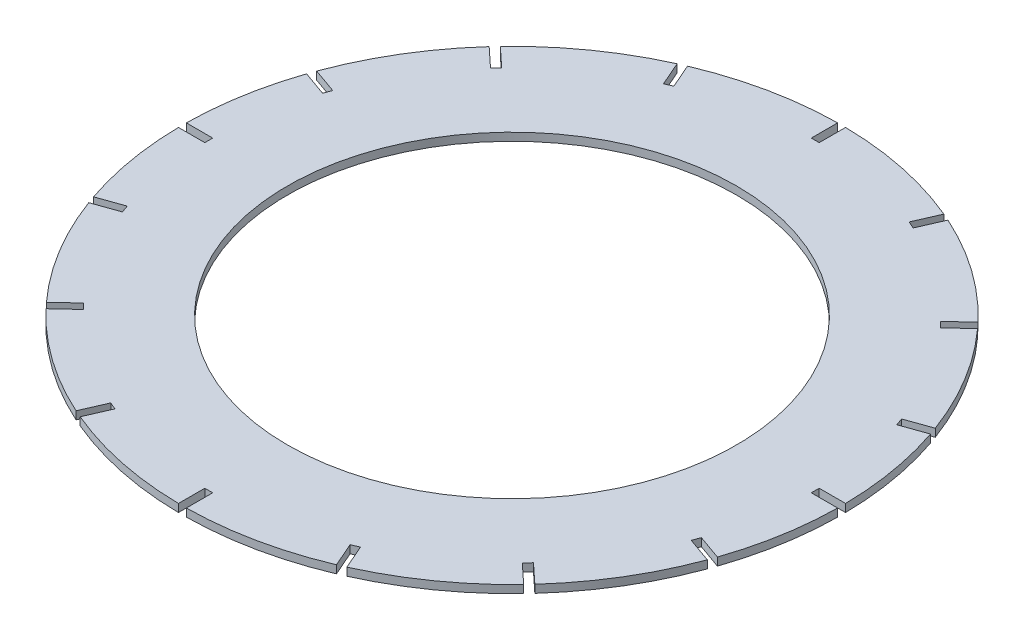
ISO-10303-21;
HEADER;
FILE_DESCRIPTION(('STEP AP214'),'2;1');
FILE_NAME('part.step','',(''),(''),'','','');
FILE_SCHEMA(('AUTOMOTIVE_DESIGN { 1 0 10303 214 1 1 1 1 }'));
ENDSEC;
DATA;
#1=APPLICATION_CONTEXT('core data for automotive mechanical design processes');
#2=APPLICATION_PROTOCOL_DEFINITION('international standard','automotive_design',2000,#1);
#3=PRODUCT_CONTEXT('',#1,'mechanical');
#4=PRODUCT('Part','Part','',(#3));
#5=PRODUCT_RELATED_PRODUCT_CATEGORY('part','',(#4));
#6=PRODUCT_DEFINITION_FORMATION('','',#4);
#7=PRODUCT_DEFINITION_CONTEXT('part definition',#1,'design');
#8=PRODUCT_DEFINITION('design','',#6,#7);
#9=PRODUCT_DEFINITION_SHAPE('','',#8);
#10=(LENGTH_UNIT() NAMED_UNIT(*) SI_UNIT(.MILLI.,.METRE.));
#11=(NAMED_UNIT(*) PLANE_ANGLE_UNIT() SI_UNIT($,.RADIAN.));
#12=(NAMED_UNIT(*) SI_UNIT($,.STERADIAN.) SOLID_ANGLE_UNIT());
#13=UNCERTAINTY_MEASURE_WITH_UNIT(LENGTH_MEASURE(1.E-05),#10,'distance_accuracy_value','');
#14=(GEOMETRIC_REPRESENTATION_CONTEXT(3) GLOBAL_UNCERTAINTY_ASSIGNED_CONTEXT((#13)) GLOBAL_UNIT_ASSIGNED_CONTEXT((#10,
#11,#12)) REPRESENTATION_CONTEXT('',''));
#15=CARTESIAN_POINT('',(0.,0.,0.));
#16=DIRECTION('',(0.,0.,1.));
#17=DIRECTION('',(1.,0.,0.));
#18=AXIS2_PLACEMENT_3D('',#15,#16,#17);
#19=CARTESIAN_POINT('',(0.,3.,0.));
#20=DIRECTION('',(0.,-1.,0.));
#21=DIRECTION('',(0.,0.,-1.));
#22=AXIS2_PLACEMENT_3D('',#19,#20,#21);
#23=CYLINDRICAL_SURFACE('',#22,125.);
#24=CARTESIAN_POINT('',(0.,0.,0.));
#25=DIRECTION('',(0.,1.,0.));
#26=DIRECTION('',(0.,0.,1.));
#27=AXIS2_PLACEMENT_3D('',#24,#25,#26);
#28=CIRCLE('',#27,125.);
#29=CARTESIAN_POINT('',(-118.291813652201,0.,-40.398599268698));
#30=VERTEX_POINT('',#29);
#31=CARTESIAN_POINT('',(-124.990999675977,0.,-1.49999999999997));
#32=VERTEX_POINT('',#31);
#33=EDGE_CURVE('E465',#30,#32,#28,.T.);
#34=ORIENTED_EDGE('',*,*,#33,.T.);
#35=DIRECTION('',(0.,-1.,0.));
#36=VECTOR('',#35,1.);
#37=CARTESIAN_POINT('',(-124.990999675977,3.,-1.49999999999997));
#38=LINE('',#37,#36);
#39=CARTESIAN_POINT('',(-124.990999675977,3.,-1.49999999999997));
#40=VERTEX_POINT('',#39);
#41=EDGE_CURVE('E11',#40,#32,#38,.T.);
#42=ORIENTED_EDGE('',*,*,#41,.F.);
#43=CARTESIAN_POINT('',(0.,3.,0.));
#44=DIRECTION('',(0.,1.,0.));
#45=DIRECTION('',(0.,0.,1.));
#46=AXIS2_PLACEMENT_3D('',#43,#44,#45);
#47=CIRCLE('',#46,125.);
#48=CARTESIAN_POINT('',(-118.291813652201,3.,-40.398599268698));
#49=VERTEX_POINT('',#48);
#50=EDGE_CURVE('E592',#49,#40,#47,.T.);
#51=ORIENTED_EDGE('',*,*,#50,.F.);
#52=DIRECTION('',(0.,-1.,0.));
#53=VECTOR('',#52,1.);
#54=CARTESIAN_POINT('',(-118.291813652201,3.,-40.398599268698));
#55=LINE('',#54,#53);
#56=EDGE_CURVE('E461',#49,#30,#55,.T.);
#57=ORIENTED_EDGE('',*,*,#56,.T.);
#58=EDGE_LOOP('',(#34,#42,#51,#57));
#59=FACE_BOUND('',#58,.T.);
#60=ADVANCED_FACE('F33',(#59),#23,.T.);
#61=CARTESIAN_POINT('',(-124.990999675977,3.,-1.49999999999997));
#62=DIRECTION('',(0.,0.,-1.));
#63=DIRECTION('',(-1.,0.,0.));
#64=AXIS2_PLACEMENT_3D('',#61,#62,#63);
#65=PLANE('',#64);
#66=DIRECTION('',(1.,0.,0.));
#67=VECTOR('',#66,1.);
#68=CARTESIAN_POINT('',(-124.990999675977,0.,-1.49999999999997));
#69=LINE('',#68,#67);
#70=CARTESIAN_POINT('',(-114.990999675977,0.,-1.49999999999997));
#71=VERTEX_POINT('',#70);
#72=EDGE_CURVE('E468',#32,#71,#69,.T.);
#73=ORIENTED_EDGE('',*,*,#72,.T.);
#74=DIRECTION('',(0.,-1.,0.));
#75=VECTOR('',#74,1.);
#76=CARTESIAN_POINT('',(-114.990999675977,3.,-1.49999999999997));
#77=LINE('',#76,#75);
#78=CARTESIAN_POINT('',(-114.990999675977,3.,-1.49999999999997));
#79=VERTEX_POINT('',#78);
#80=EDGE_CURVE('E41',#79,#71,#77,.T.);
#81=ORIENTED_EDGE('',*,*,#80,.F.);
#82=DIRECTION('',(1.,0.,0.));
#83=VECTOR('',#82,1.);
#84=CARTESIAN_POINT('',(-124.990999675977,3.,-1.49999999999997));
#85=LINE('',#84,#83);
#86=EDGE_CURVE('E260',#40,#79,#85,.T.);
#87=ORIENTED_EDGE('',*,*,#86,.F.);
#88=ORIENTED_EDGE('',*,*,#41,.T.);
#89=EDGE_LOOP('',(#73,#81,#87,#88));
#90=FACE_BOUND('',#89,.T.);
#91=ADVANCED_FACE('F932',(#90),#65,.F.);
#92=CARTESIAN_POINT('',(-114.990999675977,3.,-1.49999999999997));
#93=DIRECTION('',(1.,0.,0.));
#94=DIRECTION('',(0.,0.,-1.));
#95=AXIS2_PLACEMENT_3D('',#92,#93,#94);
#96=PLANE('',#95);
#97=DIRECTION('',(0.,0.,1.));
#98=VECTOR('',#97,1.);
#99=CARTESIAN_POINT('',(-114.990999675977,0.,-1.49999999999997));
#100=LINE('',#99,#98);
#101=CARTESIAN_POINT('',(-114.990999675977,0.,1.50000000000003));
#102=VERTEX_POINT('',#101);
#103=EDGE_CURVE('E471',#71,#102,#100,.T.);
#104=ORIENTED_EDGE('',*,*,#103,.T.);
#105=DIRECTION('',(0.,-1.,0.));
#106=VECTOR('',#105,1.);
#107=CARTESIAN_POINT('',(-114.990999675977,3.,1.50000000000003));
#108=LINE('',#107,#106);
#109=CARTESIAN_POINT('',(-114.990999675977,3.,1.50000000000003));
#110=VERTEX_POINT('',#109);
#111=EDGE_CURVE('E767',#110,#102,#108,.T.);
#112=ORIENTED_EDGE('',*,*,#111,.F.);
#113=DIRECTION('',(0.,0.,1.));
#114=VECTOR('',#113,1.);
#115=CARTESIAN_POINT('',(-114.990999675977,3.,-1.49999999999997));
#116=LINE('',#115,#114);
#117=EDGE_CURVE('E775',#79,#110,#116,.T.);
#118=ORIENTED_EDGE('',*,*,#117,.F.);
#119=ORIENTED_EDGE('',*,*,#80,.T.);
#120=EDGE_LOOP('',(#104,#112,#118,#119));
#121=FACE_BOUND('',#120,.T.);
#122=ADVANCED_FACE('F773',(#121),#96,.F.);
#123=CARTESIAN_POINT('',(-124.990999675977,3.,1.50000000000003));
#124=DIRECTION('',(0.,0.,1.));
#125=DIRECTION('',(1.,0.,0.));
#126=AXIS2_PLACEMENT_3D('',#123,#124,#125);
#127=PLANE('',#126);
#128=DIRECTION('',(-1.,0.,0.));
#129=VECTOR('',#128,1.);
#130=CARTESIAN_POINT('',(-124.990999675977,0.,1.50000000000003));
#131=LINE('',#130,#129);
#132=CARTESIAN_POINT('',(-124.990999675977,0.,1.50000000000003));
#133=VERTEX_POINT('',#132);
#134=EDGE_CURVE('E473',#102,#133,#131,.T.);
#135=ORIENTED_EDGE('',*,*,#134,.T.);
#136=DIRECTION('',(0.,-1.,0.));
#137=VECTOR('',#136,1.);
#138=CARTESIAN_POINT('',(-124.990999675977,3.,1.50000000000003));
#139=LINE('',#138,#137);
#140=CARTESIAN_POINT('',(-124.990999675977,3.,1.50000000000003));
#141=VERTEX_POINT('',#140);
#142=EDGE_CURVE('E764',#141,#133,#139,.T.);
#143=ORIENTED_EDGE('',*,*,#142,.F.);
#144=DIRECTION('',(-1.,0.,0.));
#145=VECTOR('',#144,1.);
#146=CARTESIAN_POINT('',(-124.990999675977,3.,1.50000000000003));
#147=LINE('',#146,#145);
#148=EDGE_CURVE('E793',#110,#141,#147,.T.);
#149=ORIENTED_EDGE('',*,*,#148,.F.);
#150=ORIENTED_EDGE('',*,*,#111,.T.);
#151=EDGE_LOOP('',(#135,#143,#149,#150));
#152=FACE_BOUND('',#151,.T.);
#153=ADVANCED_FACE('F784',(#152),#127,.F.);
#154=CARTESIAN_POINT('',(0.,3.,0.));
#155=DIRECTION('',(0.,-1.,0.));
#156=DIRECTION('',(0.,0.,-1.));
#157=AXIS2_PLACEMENT_3D('',#154,#155,#156);
#158=CYLINDRICAL_SURFACE('',#157,125.);
#159=CARTESIAN_POINT('',(0.,0.,0.));
#160=DIRECTION('',(0.,1.,0.));
#161=DIRECTION('',(0.,0.,1.));
#162=AXIS2_PLACEMENT_3D('',#159,#160,#161);
#163=CIRCLE('',#162,125.);
#164=CARTESIAN_POINT('',(-118.291813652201,0.,40.398599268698));
#165=VERTEX_POINT('',#164);
#166=EDGE_CURVE('E475',#133,#165,#163,.T.);
#167=ORIENTED_EDGE('',*,*,#166,.T.);
#168=DIRECTION('',(0.,-1.,0.));
#169=VECTOR('',#168,1.);
#170=CARTESIAN_POINT('',(-118.291813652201,3.,40.398599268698));
#171=LINE('',#170,#169);
#172=CARTESIAN_POINT('',(-118.291813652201,3.,40.398599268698));
#173=VERTEX_POINT('',#172);
#174=EDGE_CURVE('E761',#173,#165,#171,.T.);
#175=ORIENTED_EDGE('',*,*,#174,.F.);
#176=CARTESIAN_POINT('',(0.,3.,0.));
#177=DIRECTION('',(0.,1.,0.));
#178=DIRECTION('',(0.,0.,1.));
#179=AXIS2_PLACEMENT_3D('',#176,#177,#178);
#180=CIRCLE('',#179,125.);
#181=EDGE_CURVE('E790',#141,#173,#180,.T.);
#182=ORIENTED_EDGE('',*,*,#181,.F.);
#183=ORIENTED_EDGE('',*,*,#142,.T.);
#184=EDGE_LOOP('',(#167,#175,#182,#183));
#185=FACE_BOUND('',#184,.T.);
#186=ADVANCED_FACE('F788',(#185),#158,.T.);
#187=CARTESIAN_POINT('',(-118.291813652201,3.,40.398599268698));
#188=DIRECTION('',(-0.334521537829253,0.,-0.942388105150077));
#189=DIRECTION('',(-0.942388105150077,0.,0.334521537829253));
#190=AXIS2_PLACEMENT_3D('',#187,#188,#189);
#191=PLANE('',#190);
#192=DIRECTION('',(0.942388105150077,0.,-0.334521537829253));
#193=VECTOR('',#192,1.);
#194=CARTESIAN_POINT('',(-118.291813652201,0.,40.398599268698));
#195=LINE('',#194,#193);
#196=CARTESIAN_POINT('',(-108.867932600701,0.,37.0533838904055));
#197=VERTEX_POINT('',#196);
#198=EDGE_CURVE('E477',#165,#197,#195,.T.);
#199=ORIENTED_EDGE('',*,*,#198,.T.);
#200=DIRECTION('',(0.,-1.,0.));
#201=VECTOR('',#200,1.);
#202=CARTESIAN_POINT('',(-108.867932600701,3.,37.0533838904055));
#203=LINE('',#202,#201);
#204=CARTESIAN_POINT('',(-108.867932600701,3.,37.0533838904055));
#205=VERTEX_POINT('',#204);
#206=EDGE_CURVE('E758',#205,#197,#203,.T.);
#207=ORIENTED_EDGE('',*,*,#206,.F.);
#208=DIRECTION('',(0.942388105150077,0.,-0.334521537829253));
#209=VECTOR('',#208,1.);
#210=CARTESIAN_POINT('',(-118.291813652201,3.,40.398599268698));
#211=LINE('',#210,#209);
#212=EDGE_CURVE('E792',#173,#205,#211,.T.);
#213=ORIENTED_EDGE('',*,*,#212,.F.);
#214=ORIENTED_EDGE('',*,*,#174,.T.);
#215=EDGE_LOOP('',(#199,#207,#213,#214));
#216=FACE_BOUND('',#215,.T.);
#217=ADVANCED_FACE('F945',(#216),#191,.F.);
#218=CARTESIAN_POINT('',(-107.864367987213,3.,39.8805482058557));
#219=DIRECTION('',(0.942388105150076,0.,-0.334521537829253));
#220=DIRECTION('',(-0.334521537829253,0.,-0.942388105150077));
#221=AXIS2_PLACEMENT_3D('',#218,#219,#220);
#222=PLANE('',#221);
#223=DIRECTION('',(0.334521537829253,0.,0.942388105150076));
#224=VECTOR('',#223,1.);
#225=CARTESIAN_POINT('',(-107.864367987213,0.,39.8805482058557));
#226=LINE('',#225,#224);
#227=CARTESIAN_POINT('',(-107.864367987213,0.,39.8805482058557));
#228=VERTEX_POINT('',#227);
#229=EDGE_CURVE('E479',#197,#228,#226,.T.);
#230=ORIENTED_EDGE('',*,*,#229,.T.);
#231=DIRECTION('',(0.,-1.,0.));
#232=VECTOR('',#231,1.);
#233=CARTESIAN_POINT('',(-107.864367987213,3.,39.8805482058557));
#234=LINE('',#233,#232);
#235=CARTESIAN_POINT('',(-107.864367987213,3.,39.8805482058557));
#236=VERTEX_POINT('',#235);
#237=EDGE_CURVE('E755',#236,#228,#234,.T.);
#238=ORIENTED_EDGE('',*,*,#237,.F.);
#239=DIRECTION('',(0.334521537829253,0.,0.942388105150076));
#240=VECTOR('',#239,1.);
#241=CARTESIAN_POINT('',(-107.864367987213,3.,39.8805482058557));
#242=LINE('',#241,#240);
#243=EDGE_CURVE('E795',#205,#236,#242,.T.);
#244=ORIENTED_EDGE('',*,*,#243,.F.);
#245=ORIENTED_EDGE('',*,*,#206,.T.);
#246=EDGE_LOOP('',(#230,#238,#244,#245));
#247=FACE_BOUND('',#246,.T.);
#248=ADVANCED_FACE('F948',(#247),#222,.F.);
#249=CARTESIAN_POINT('',(-117.288249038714,3.,43.2257635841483));
#250=DIRECTION('',(0.334521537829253,0.,0.942388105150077));
#251=DIRECTION('',(0.942388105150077,0.,-0.334521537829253));
#252=AXIS2_PLACEMENT_3D('',#249,#250,#251);
#253=PLANE('',#252);
#254=DIRECTION('',(-0.942388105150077,0.,0.334521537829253));
#255=VECTOR('',#254,1.);
#256=CARTESIAN_POINT('',(-117.288249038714,0.,43.2257635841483));
#257=LINE('',#256,#255);
#258=CARTESIAN_POINT('',(-117.288249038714,0.,43.2257635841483));
#259=VERTEX_POINT('',#258);
#260=EDGE_CURVE('E481',#228,#259,#257,.T.);
#261=ORIENTED_EDGE('',*,*,#260,.T.);
#262=DIRECTION('',(0.,-1.,0.));
#263=VECTOR('',#262,1.);
#264=CARTESIAN_POINT('',(-117.288249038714,3.,43.2257635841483));
#265=LINE('',#264,#263);
#266=CARTESIAN_POINT('',(-117.288249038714,3.,43.2257635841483));
#267=VERTEX_POINT('',#266);
#268=EDGE_CURVE('E752',#267,#259,#265,.T.);
#269=ORIENTED_EDGE('',*,*,#268,.F.);
#270=DIRECTION('',(-0.942388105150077,0.,0.334521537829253));
#271=VECTOR('',#270,1.);
#272=CARTESIAN_POINT('',(-117.288249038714,3.,43.2257635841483));
#273=LINE('',#272,#271);
#274=EDGE_CURVE('E801',#236,#267,#273,.T.);
#275=ORIENTED_EDGE('',*,*,#274,.F.);
#276=ORIENTED_EDGE('',*,*,#237,.T.);
#277=EDGE_LOOP('',(#261,#269,#275,#276));
#278=FACE_BOUND('',#277,.T.);
#279=ADVANCED_FACE('F952',(#278),#253,.F.);
#280=CARTESIAN_POINT('',(0.,3.,0.));
#281=DIRECTION('',(0.,-1.,0.));
#282=DIRECTION('',(0.,0.,-1.));
#283=AXIS2_PLACEMENT_3D('',#280,#281,#282);
#284=CYLINDRICAL_SURFACE('',#283,125.);
#285=CARTESIAN_POINT('',(0.,0.,0.));
#286=DIRECTION('',(0.,1.,0.));
#287=DIRECTION('',(0.,0.,1.));
#288=AXIS2_PLACEMENT_3D('',#285,#286,#287);
#289=CIRCLE('',#288,125.);
#290=CARTESIAN_POINT('',(-92.6152921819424,0.,83.9488395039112));
#291=VERTEX_POINT('',#290);
#292=EDGE_CURVE('E483',#259,#291,#289,.T.);
#293=ORIENTED_EDGE('',*,*,#292,.T.);
#294=DIRECTION('',(0.,-1.,0.));
#295=VECTOR('',#294,1.);
#296=CARTESIAN_POINT('',(-92.6152921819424,3.,83.9488395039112));
#297=LINE('',#296,#295);
#298=CARTESIAN_POINT('',(-92.6152921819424,3.,83.9488395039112));
#299=VERTEX_POINT('',#298);
#300=EDGE_CURVE('E749',#299,#291,#297,.T.);
#301=ORIENTED_EDGE('',*,*,#300,.F.);
#302=CARTESIAN_POINT('',(0.,3.,0.));
#303=DIRECTION('',(0.,1.,0.));
#304=DIRECTION('',(0.,0.,1.));
#305=AXIS2_PLACEMENT_3D('',#302,#303,#304);
#306=CIRCLE('',#305,125.);
#307=EDGE_CURVE('E803',#267,#299,#306,.T.);
#308=ORIENTED_EDGE('',*,*,#307,.F.);
#309=ORIENTED_EDGE('',*,*,#268,.T.);
#310=EDGE_LOOP('',(#293,#301,#308,#309));
#311=FACE_BOUND('',#310,.T.);
#312=ADVANCED_FACE('F956',(#311),#284,.T.);
#313=CARTESIAN_POINT('',(-92.6152921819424,3.,83.9488395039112));
#314=DIRECTION('',(-0.680433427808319,0.,-0.732809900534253));
#315=DIRECTION('',(-0.732809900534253,0.,0.680433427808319));
#316=AXIS2_PLACEMENT_3D('',#313,#314,#315);
#317=PLANE('',#316);
#318=DIRECTION('',(0.732809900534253,0.,-0.680433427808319));
#319=VECTOR('',#318,1.);
#320=CARTESIAN_POINT('',(-92.6152921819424,0.,83.9488395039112));
#321=LINE('',#320,#319);
#322=CARTESIAN_POINT('',(-85.2871931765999,0.,77.144505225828));
#323=VERTEX_POINT('',#322);
#324=EDGE_CURVE('E485',#291,#323,#321,.T.);
#325=ORIENTED_EDGE('',*,*,#324,.T.);
#326=DIRECTION('',(0.,-1.,0.));
#327=VECTOR('',#326,1.);
#328=CARTESIAN_POINT('',(-85.2871931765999,3.,77.144505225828));
#329=LINE('',#328,#327);
#330=CARTESIAN_POINT('',(-85.2871931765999,3.,77.144505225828));
#331=VERTEX_POINT('',#330);
#332=EDGE_CURVE('E746',#331,#323,#329,.T.);
#333=ORIENTED_EDGE('',*,*,#332,.F.);
#334=DIRECTION('',(0.732809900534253,0.,-0.680433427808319));
#335=VECTOR('',#334,1.);
#336=CARTESIAN_POINT('',(-92.6152921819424,3.,83.9488395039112));
#337=LINE('',#336,#335);
#338=EDGE_CURVE('E805',#299,#331,#337,.T.);
#339=ORIENTED_EDGE('',*,*,#338,.F.);
#340=ORIENTED_EDGE('',*,*,#300,.T.);
#341=EDGE_LOOP('',(#325,#333,#339,#340));
#342=FACE_BOUND('',#341,.T.);
#343=ADVANCED_FACE('F960',(#342),#317,.F.);
#344=CARTESIAN_POINT('',(-83.2458928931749,3.,79.3429349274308));
#345=DIRECTION('',(0.732809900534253,0.,-0.680433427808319));
#346=DIRECTION('',(-0.680433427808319,0.,-0.732809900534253));
#347=AXIS2_PLACEMENT_3D('',#344,#345,#346);
#348=PLANE('',#347);
#349=DIRECTION('',(0.680433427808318,0.,0.732809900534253));
#350=VECTOR('',#349,1.);
#351=CARTESIAN_POINT('',(-83.2458928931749,0.,79.3429349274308));
#352=LINE('',#351,#350);
#353=CARTESIAN_POINT('',(-83.2458928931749,0.,79.3429349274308));
#354=VERTEX_POINT('',#353);
#355=EDGE_CURVE('E487',#323,#354,#352,.T.);
#356=ORIENTED_EDGE('',*,*,#355,.T.);
#357=DIRECTION('',(0.,-1.,0.));
#358=VECTOR('',#357,1.);
#359=CARTESIAN_POINT('',(-83.2458928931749,3.,79.3429349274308));
#360=LINE('',#359,#358);
#361=CARTESIAN_POINT('',(-83.2458928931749,3.,79.3429349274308));
#362=VERTEX_POINT('',#361);
#363=EDGE_CURVE('E743',#362,#354,#360,.T.);
#364=ORIENTED_EDGE('',*,*,#363,.F.);
#365=DIRECTION('',(0.680433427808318,0.,0.732809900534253));
#366=VECTOR('',#365,1.);
#367=CARTESIAN_POINT('',(-83.2458928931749,3.,79.3429349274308));
#368=LINE('',#367,#366);
#369=EDGE_CURVE('E807',#331,#362,#368,.T.);
#370=ORIENTED_EDGE('',*,*,#369,.F.);
#371=ORIENTED_EDGE('',*,*,#332,.T.);
#372=EDGE_LOOP('',(#356,#364,#370,#371));
#373=FACE_BOUND('',#372,.T.);
#374=ADVANCED_FACE('F964',(#373),#348,.F.);
#375=CARTESIAN_POINT('',(-90.5739918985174,3.,86.147269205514));
#376=DIRECTION('',(0.680433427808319,0.,0.732809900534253));
#377=DIRECTION('',(0.732809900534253,0.,-0.680433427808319));
#378=AXIS2_PLACEMENT_3D('',#375,#376,#377);
#379=PLANE('',#378);
#380=DIRECTION('',(-0.732809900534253,0.,0.680433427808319));
#381=VECTOR('',#380,1.);
#382=CARTESIAN_POINT('',(-90.5739918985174,0.,86.147269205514));
#383=LINE('',#382,#381);
#384=CARTESIAN_POINT('',(-90.5739918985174,0.,86.147269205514));
#385=VERTEX_POINT('',#384);
#386=EDGE_CURVE('E489',#354,#385,#383,.T.);
#387=ORIENTED_EDGE('',*,*,#386,.T.);
#388=DIRECTION('',(0.,-1.,0.));
#389=VECTOR('',#388,1.);
#390=CARTESIAN_POINT('',(-90.5739918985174,3.,86.147269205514));
#391=LINE('',#390,#389);
#392=CARTESIAN_POINT('',(-90.5739918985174,3.,86.147269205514));
#393=VERTEX_POINT('',#392);
#394=EDGE_CURVE('E740',#393,#385,#391,.T.);
#395=ORIENTED_EDGE('',*,*,#394,.F.);
#396=DIRECTION('',(-0.732809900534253,0.,0.680433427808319));
#397=VECTOR('',#396,1.);
#398=CARTESIAN_POINT('',(-90.5739918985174,3.,86.147269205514));
#399=LINE('',#398,#397);
#400=EDGE_CURVE('E809',#362,#393,#399,.T.);
#401=ORIENTED_EDGE('',*,*,#400,.F.);
#402=ORIENTED_EDGE('',*,*,#363,.T.);
#403=EDGE_LOOP('',(#387,#395,#401,#402));
#404=FACE_BOUND('',#403,.T.);
#405=ADVANCED_FACE('F968',(#404),#379,.F.);
#406=CARTESIAN_POINT('',(0.,3.,0.));
#407=DIRECTION('',(0.,-1.,0.));
#408=DIRECTION('',(0.,0.,-1.));
#409=AXIS2_PLACEMENT_3D('',#406,#407,#408);
#410=CYLINDRICAL_SURFACE('',#409,125.);
#411=CARTESIAN_POINT('',(0.,0.,0.));
#412=DIRECTION('',(0.,1.,0.));
#413=DIRECTION('',(0.,0.,1.));
#414=AXIS2_PLACEMENT_3D('',#411,#412,#413);
#415=CIRCLE('',#414,125.);
#416=CARTESIAN_POINT('',(-51.3493487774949,0.,113.965979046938));
#417=VERTEX_POINT('',#416);
#418=EDGE_CURVE('E491',#385,#417,#415,.T.);
#419=ORIENTED_EDGE('',*,*,#418,.T.);
#420=DIRECTION('',(0.,-1.,0.));
#421=VECTOR('',#420,1.);
#422=CARTESIAN_POINT('',(-51.3493487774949,3.,113.965979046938));
#423=LINE('',#422,#421);
#424=CARTESIAN_POINT('',(-51.3493487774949,3.,113.965979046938));
#425=VERTEX_POINT('',#424);
#426=EDGE_CURVE('E737',#425,#417,#423,.T.);
#427=ORIENTED_EDGE('',*,*,#426,.F.);
#428=CARTESIAN_POINT('',(0.,3.,0.));
#429=DIRECTION('',(0.,1.,0.));
#430=DIRECTION('',(0.,0.,1.));
#431=AXIS2_PLACEMENT_3D('',#428,#429,#430);
#432=CIRCLE('',#431,125.);
#433=EDGE_CURVE('E811',#393,#425,#432,.T.);
#434=ORIENTED_EDGE('',*,*,#433,.F.);
#435=ORIENTED_EDGE('',*,*,#394,.T.);
#436=EDGE_LOOP('',(#419,#427,#434,#435));
#437=FACE_BOUND('',#436,.T.);
#438=ADVANCED_FACE('F972',(#437),#410,.T.);
#439=CARTESIAN_POINT('',(-51.3493487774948,3.,113.965979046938));
#440=DIRECTION('',(-0.916591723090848,0.,-0.399824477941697));
#441=DIRECTION('',(-0.399824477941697,0.,0.916591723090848));
#442=AXIS2_PLACEMENT_3D('',#439,#440,#441);
#443=PLANE('',#442);
#444=DIRECTION('',(0.399824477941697,0.,-0.916591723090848));
#445=VECTOR('',#444,1.);
#446=CARTESIAN_POINT('',(-51.3493487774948,0.,113.965979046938));
#447=LINE('',#446,#445);
#448=CARTESIAN_POINT('',(-47.3511039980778,0.,104.80006181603));
#449=VERTEX_POINT('',#448);
#450=EDGE_CURVE('E493',#417,#449,#447,.T.);
#451=ORIENTED_EDGE('',*,*,#450,.T.);
#452=DIRECTION('',(0.,-1.,0.));
#453=VECTOR('',#452,1.);
#454=CARTESIAN_POINT('',(-47.3511039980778,3.,104.80006181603));
#455=LINE('',#454,#453);
#456=CARTESIAN_POINT('',(-47.3511039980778,3.,104.80006181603));
#457=VERTEX_POINT('',#456);
#458=EDGE_CURVE('E734',#457,#449,#455,.T.);
#459=ORIENTED_EDGE('',*,*,#458,.F.);
#460=DIRECTION('',(0.399824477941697,0.,-0.916591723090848));
#461=VECTOR('',#460,1.);
#462=CARTESIAN_POINT('',(-51.3493487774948,3.,113.965979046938));
#463=LINE('',#462,#461);
#464=EDGE_CURVE('E813',#425,#457,#463,.T.);
#465=ORIENTED_EDGE('',*,*,#464,.F.);
#466=ORIENTED_EDGE('',*,*,#426,.T.);
#467=EDGE_LOOP('',(#451,#459,#465,#466));
#468=FACE_BOUND('',#467,.T.);
#469=ADVANCED_FACE('F976',(#468),#443,.F.);
#470=CARTESIAN_POINT('',(-44.6013288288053,3.,105.999535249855));
#471=DIRECTION('',(0.399824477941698,0.,-0.916591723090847));
#472=DIRECTION('',(-0.916591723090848,0.,-0.399824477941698));
#473=AXIS2_PLACEMENT_3D('',#470,#471,#472);
#474=PLANE('',#473);
#475=DIRECTION('',(0.916591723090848,0.,0.399824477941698));
#476=VECTOR('',#475,1.);
#477=CARTESIAN_POINT('',(-44.6013288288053,0.,105.999535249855));
#478=LINE('',#477,#476);
#479=CARTESIAN_POINT('',(-44.6013288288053,0.,105.999535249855));
#480=VERTEX_POINT('',#479);
#481=EDGE_CURVE('E495',#449,#480,#478,.T.);
#482=ORIENTED_EDGE('',*,*,#481,.T.);
#483=DIRECTION('',(0.,-1.,0.));
#484=VECTOR('',#483,1.);
#485=CARTESIAN_POINT('',(-44.6013288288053,3.,105.999535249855));
#486=LINE('',#485,#484);
#487=CARTESIAN_POINT('',(-44.6013288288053,3.,105.999535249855));
#488=VERTEX_POINT('',#487);
#489=EDGE_CURVE('E731',#488,#480,#486,.T.);
#490=ORIENTED_EDGE('',*,*,#489,.F.);
#491=DIRECTION('',(0.916591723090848,0.,0.399824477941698));
#492=VECTOR('',#491,1.);
#493=CARTESIAN_POINT('',(-44.6013288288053,3.,105.999535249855));
#494=LINE('',#493,#492);
#495=EDGE_CURVE('E815',#457,#488,#494,.T.);
#496=ORIENTED_EDGE('',*,*,#495,.F.);
#497=ORIENTED_EDGE('',*,*,#458,.T.);
#498=EDGE_LOOP('',(#482,#490,#496,#497));
#499=FACE_BOUND('',#498,.T.);
#500=ADVANCED_FACE('F980',(#499),#474,.F.);
#501=CARTESIAN_POINT('',(-48.5995736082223,3.,115.165452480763));
#502=DIRECTION('',(0.916591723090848,0.,0.399824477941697));
#503=DIRECTION('',(0.399824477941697,0.,-0.916591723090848));
#504=AXIS2_PLACEMENT_3D('',#501,#502,#503);
#505=PLANE('',#504);
#506=DIRECTION('',(-0.399824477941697,0.,0.916591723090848));
#507=VECTOR('',#506,1.);
#508=CARTESIAN_POINT('',(-48.5995736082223,0.,115.165452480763));
#509=LINE('',#508,#507);
#510=CARTESIAN_POINT('',(-48.5995736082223,0.,115.165452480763));
#511=VERTEX_POINT('',#510);
#512=EDGE_CURVE('E497',#480,#511,#509,.T.);
#513=ORIENTED_EDGE('',*,*,#512,.T.);
#514=DIRECTION('',(0.,-1.,0.));
#515=VECTOR('',#514,1.);
#516=CARTESIAN_POINT('',(-48.5995736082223,3.,115.165452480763));
#517=LINE('',#516,#515);
#518=CARTESIAN_POINT('',(-48.5995736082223,3.,115.165452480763));
#519=VERTEX_POINT('',#518);
#520=EDGE_CURVE('E728',#519,#511,#517,.T.);
#521=ORIENTED_EDGE('',*,*,#520,.F.);
#522=DIRECTION('',(-0.399824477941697,0.,0.916591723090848));
#523=VECTOR('',#522,1.);
#524=CARTESIAN_POINT('',(-48.5995736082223,3.,115.165452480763));
#525=LINE('',#524,#523);
#526=EDGE_CURVE('E817',#488,#519,#525,.T.);
#527=ORIENTED_EDGE('',*,*,#526,.F.);
#528=ORIENTED_EDGE('',*,*,#489,.T.);
#529=EDGE_LOOP('',(#513,#521,#527,#528));
#530=FACE_BOUND('',#529,.T.);
#531=ADVANCED_FACE('F984',(#530),#505,.F.);
#532=CARTESIAN_POINT('',(0.,3.,0.));
#533=DIRECTION('',(0.,-1.,0.));
#534=DIRECTION('',(0.,0.,-1.));
#535=AXIS2_PLACEMENT_3D('',#532,#533,#534);
#536=CYLINDRICAL_SURFACE('',#535,125.);
#537=CARTESIAN_POINT('',(0.,0.,0.));
#538=DIRECTION('',(0.,1.,0.));
#539=DIRECTION('',(0.,0.,1.));
#540=AXIS2_PLACEMENT_3D('',#537,#538,#539);
#541=CIRCLE('',#540,125.);
#542=CARTESIAN_POINT('',(-1.49999999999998,0.,124.990999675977));
#543=VERTEX_POINT('',#542);
#544=EDGE_CURVE('E499',#511,#543,#541,.T.);
#545=ORIENTED_EDGE('',*,*,#544,.T.);
#546=DIRECTION('',(0.,-1.,0.));
#547=VECTOR('',#546,1.);
#548=CARTESIAN_POINT('',(-1.49999999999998,3.,124.990999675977));
#549=LINE('',#548,#547);
#550=CARTESIAN_POINT('',(-1.49999999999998,3.,124.990999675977));
#551=VERTEX_POINT('',#550);
#552=EDGE_CURVE('E725',#551,#543,#549,.T.);
#553=ORIENTED_EDGE('',*,*,#552,.F.);
#554=CARTESIAN_POINT('',(0.,3.,0.));
#555=DIRECTION('',(0.,1.,0.));
#556=DIRECTION('',(0.,0.,1.));
#557=AXIS2_PLACEMENT_3D('',#554,#555,#556);
#558=CIRCLE('',#557,125.);
#559=EDGE_CURVE('E819',#519,#551,#558,.T.);
#560=ORIENTED_EDGE('',*,*,#559,.F.);
#561=ORIENTED_EDGE('',*,*,#520,.T.);
#562=EDGE_LOOP('',(#545,#553,#560,#561));
#563=FACE_BOUND('',#562,.T.);
#564=ADVANCED_FACE('F988',(#563),#536,.T.);
#565=CARTESIAN_POINT('',(-1.5,3.,124.990999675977));
#566=DIRECTION('',(-1.,0.,0.));
#567=DIRECTION('',(0.,0.,1.));
#568=AXIS2_PLACEMENT_3D('',#565,#566,#567);
#569=PLANE('',#568);
#570=DIRECTION('',(0.,0.,-1.));
#571=VECTOR('',#570,1.);
#572=CARTESIAN_POINT('',(-1.5,0.,124.990999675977));
#573=LINE('',#572,#571);
#574=CARTESIAN_POINT('',(-1.5,0.,114.990999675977));
#575=VERTEX_POINT('',#574);
#576=EDGE_CURVE('E501',#543,#575,#573,.T.);
#577=ORIENTED_EDGE('',*,*,#576,.T.);
#578=DIRECTION('',(0.,-1.,0.));
#579=VECTOR('',#578,1.);
#580=CARTESIAN_POINT('',(-1.5,3.,114.990999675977));
#581=LINE('',#580,#579);
#582=CARTESIAN_POINT('',(-1.5,3.,114.990999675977));
#583=VERTEX_POINT('',#582);
#584=EDGE_CURVE('E722',#583,#575,#581,.T.);
#585=ORIENTED_EDGE('',*,*,#584,.F.);
#586=DIRECTION('',(0.,0.,-1.));
#587=VECTOR('',#586,1.);
#588=CARTESIAN_POINT('',(-1.5,3.,124.990999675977));
#589=LINE('',#588,#587);
#590=EDGE_CURVE('E821',#551,#583,#589,.T.);
#591=ORIENTED_EDGE('',*,*,#590,.F.);
#592=ORIENTED_EDGE('',*,*,#552,.T.);
#593=EDGE_LOOP('',(#577,#585,#591,#592));
#594=FACE_BOUND('',#593,.T.);
#595=ADVANCED_FACE('F992',(#594),#569,.F.);
#596=CARTESIAN_POINT('',(-1.5,3.,114.990999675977));
#597=DIRECTION('',(0.,0.,-1.));
#598=DIRECTION('',(-1.,0.,0.));
#599=AXIS2_PLACEMENT_3D('',#596,#597,#598);
#600=PLANE('',#599);
#601=DIRECTION('',(1.,0.,0.));
#602=VECTOR('',#601,1.);
#603=CARTESIAN_POINT('',(-1.5,0.,114.990999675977));
#604=LINE('',#603,#602);
#605=CARTESIAN_POINT('',(1.5,0.,114.990999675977));
#606=VERTEX_POINT('',#605);
#607=EDGE_CURVE('E503',#575,#606,#604,.T.);
#608=ORIENTED_EDGE('',*,*,#607,.T.);
#609=DIRECTION('',(0.,-1.,0.));
#610=VECTOR('',#609,1.);
#611=CARTESIAN_POINT('',(1.5,3.,114.990999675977));
#612=LINE('',#611,#610);
#613=CARTESIAN_POINT('',(1.5,3.,114.990999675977));
#614=VERTEX_POINT('',#613);
#615=EDGE_CURVE('E719',#614,#606,#612,.T.);
#616=ORIENTED_EDGE('',*,*,#615,.F.);
#617=DIRECTION('',(1.,0.,0.));
#618=VECTOR('',#617,1.);
#619=CARTESIAN_POINT('',(-1.5,3.,114.990999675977));
#620=LINE('',#619,#618);
#621=EDGE_CURVE('E823',#583,#614,#620,.T.);
#622=ORIENTED_EDGE('',*,*,#621,.F.);
#623=ORIENTED_EDGE('',*,*,#584,.T.);
#624=EDGE_LOOP('',(#608,#616,#622,#623));
#625=FACE_BOUND('',#624,.T.);
#626=ADVANCED_FACE('F996',(#625),#600,.F.);
#627=CARTESIAN_POINT('',(1.5,3.,124.990999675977));
#628=DIRECTION('',(1.,0.,0.));
#629=DIRECTION('',(0.,0.,-1.));
#630=AXIS2_PLACEMENT_3D('',#627,#628,#629);
#631=PLANE('',#630);
#632=DIRECTION('',(0.,0.,1.));
#633=VECTOR('',#632,1.);
#634=CARTESIAN_POINT('',(1.5,0.,124.990999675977));
#635=LINE('',#634,#633);
#636=CARTESIAN_POINT('',(1.5,0.,124.990999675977));
#637=VERTEX_POINT('',#636);
#638=EDGE_CURVE('E505',#606,#637,#635,.T.);
#639=ORIENTED_EDGE('',*,*,#638,.T.);
#640=DIRECTION('',(0.,-1.,0.));
#641=VECTOR('',#640,1.);
#642=CARTESIAN_POINT('',(1.5,3.,124.990999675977));
#643=LINE('',#642,#641);
#644=CARTESIAN_POINT('',(1.5,3.,124.990999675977));
#645=VERTEX_POINT('',#644);
#646=EDGE_CURVE('E716',#645,#637,#643,.T.);
#647=ORIENTED_EDGE('',*,*,#646,.F.);
#648=DIRECTION('',(0.,0.,1.));
#649=VECTOR('',#648,1.);
#650=CARTESIAN_POINT('',(1.5,3.,124.990999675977));
#651=LINE('',#650,#649);
#652=EDGE_CURVE('E825',#614,#645,#651,.T.);
#653=ORIENTED_EDGE('',*,*,#652,.F.);
#654=ORIENTED_EDGE('',*,*,#615,.T.);
#655=EDGE_LOOP('',(#639,#647,#653,#654));
#656=FACE_BOUND('',#655,.T.);
#657=ADVANCED_FACE('F1000',(#656),#631,.F.);
#658=CARTESIAN_POINT('',(0.,3.,0.));
#659=DIRECTION('',(0.,-1.,0.));
#660=DIRECTION('',(0.,0.,-1.));
#661=AXIS2_PLACEMENT_3D('',#658,#659,#660);
#662=CYLINDRICAL_SURFACE('',#661,125.);
#663=CARTESIAN_POINT('',(0.,0.,0.));
#664=DIRECTION('',(0.,1.,0.));
#665=DIRECTION('',(0.,0.,1.));
#666=AXIS2_PLACEMENT_3D('',#663,#664,#665);
#667=CIRCLE('',#666,125.);
#668=CARTESIAN_POINT('',(48.5995736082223,0.,115.165452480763));
#669=VERTEX_POINT('',#668);
#670=EDGE_CURVE('E507',#637,#669,#667,.T.);
#671=ORIENTED_EDGE('',*,*,#670,.T.);
#672=DIRECTION('',(0.,-1.,0.));
#673=VECTOR('',#672,1.);
#674=CARTESIAN_POINT('',(48.5995736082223,3.,115.165452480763));
#675=LINE('',#674,#673);
#676=CARTESIAN_POINT('',(48.5995736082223,3.,115.165452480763));
#677=VERTEX_POINT('',#676);
#678=EDGE_CURVE('E713',#677,#669,#675,.T.);
#679=ORIENTED_EDGE('',*,*,#678,.F.);
#680=CARTESIAN_POINT('',(0.,3.,0.));
#681=DIRECTION('',(0.,1.,0.));
#682=DIRECTION('',(0.,0.,1.));
#683=AXIS2_PLACEMENT_3D('',#680,#681,#682);
#684=CIRCLE('',#683,125.);
#685=EDGE_CURVE('E827',#645,#677,#684,.T.);
#686=ORIENTED_EDGE('',*,*,#685,.F.);
#687=ORIENTED_EDGE('',*,*,#646,.T.);
#688=EDGE_LOOP('',(#671,#679,#686,#687));
#689=FACE_BOUND('',#688,.T.);
#690=ADVANCED_FACE('F1004',(#689),#662,.T.);
#691=CARTESIAN_POINT('',(48.5995736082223,3.,115.165452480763));
#692=DIRECTION('',(-0.916591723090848,0.,0.399824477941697));
#693=DIRECTION('',(0.399824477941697,0.,0.916591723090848));
#694=AXIS2_PLACEMENT_3D('',#691,#692,#693);
#695=PLANE('',#694);
#696=DIRECTION('',(-0.399824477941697,0.,-0.916591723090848));
#697=VECTOR('',#696,1.);
#698=CARTESIAN_POINT('',(48.5995736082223,0.,115.165452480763));
#699=LINE('',#698,#697);
#700=CARTESIAN_POINT('',(44.6013288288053,0.,105.999535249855));
#701=VERTEX_POINT('',#700);
#702=EDGE_CURVE('E509',#669,#701,#699,.T.);
#703=ORIENTED_EDGE('',*,*,#702,.T.);
#704=DIRECTION('',(0.,-1.,0.));
#705=VECTOR('',#704,1.);
#706=CARTESIAN_POINT('',(44.6013288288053,3.,105.999535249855));
#707=LINE('',#706,#705);
#708=CARTESIAN_POINT('',(44.6013288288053,3.,105.999535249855));
#709=VERTEX_POINT('',#708);
#710=EDGE_CURVE('E710',#709,#701,#707,.T.);
#711=ORIENTED_EDGE('',*,*,#710,.F.);
#712=DIRECTION('',(-0.399824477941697,0.,-0.916591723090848));
#713=VECTOR('',#712,1.);
#714=CARTESIAN_POINT('',(48.5995736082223,3.,115.165452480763));
#715=LINE('',#714,#713);
#716=EDGE_CURVE('E829',#677,#709,#715,.T.);
#717=ORIENTED_EDGE('',*,*,#716,.F.);
#718=ORIENTED_EDGE('',*,*,#678,.T.);
#719=EDGE_LOOP('',(#703,#711,#717,#718));
#720=FACE_BOUND('',#719,.T.);
#721=ADVANCED_FACE('F1008',(#720),#695,.F.);
#722=CARTESIAN_POINT('',(44.6013288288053,3.,105.999535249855));
#723=DIRECTION('',(-0.399824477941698,0.,-0.916591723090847));
#724=DIRECTION('',(-0.916591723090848,0.,0.399824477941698));
#725=AXIS2_PLACEMENT_3D('',#722,#723,#724);
#726=PLANE('',#725);
#727=DIRECTION('',(0.916591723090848,0.,-0.399824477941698));
#728=VECTOR('',#727,1.);
#729=CARTESIAN_POINT('',(44.6013288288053,0.,105.999535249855));
#730=LINE('',#729,#728);
#731=CARTESIAN_POINT('',(47.3511039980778,0.,104.80006181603));
#732=VERTEX_POINT('',#731);
#733=EDGE_CURVE('E511',#701,#732,#730,.T.);
#734=ORIENTED_EDGE('',*,*,#733,.T.);
#735=DIRECTION('',(0.,-1.,0.));
#736=VECTOR('',#735,1.);
#737=CARTESIAN_POINT('',(47.3511039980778,3.,104.80006181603));
#738=LINE('',#737,#736);
#739=CARTESIAN_POINT('',(47.3511039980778,3.,104.80006181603));
#740=VERTEX_POINT('',#739);
#741=EDGE_CURVE('E707',#740,#732,#738,.T.);
#742=ORIENTED_EDGE('',*,*,#741,.F.);
#743=DIRECTION('',(0.916591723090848,0.,-0.399824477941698));
#744=VECTOR('',#743,1.);
#745=CARTESIAN_POINT('',(44.6013288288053,3.,105.999535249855));
#746=LINE('',#745,#744);
#747=EDGE_CURVE('E831',#709,#740,#746,.T.);
#748=ORIENTED_EDGE('',*,*,#747,.F.);
#749=ORIENTED_EDGE('',*,*,#710,.T.);
#750=EDGE_LOOP('',(#734,#742,#748,#749));
#751=FACE_BOUND('',#750,.T.);
#752=ADVANCED_FACE('F1012',(#751),#726,.F.);
#753=CARTESIAN_POINT('',(51.3493487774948,3.,113.965979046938));
#754=DIRECTION('',(0.916591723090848,0.,-0.399824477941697));
#755=DIRECTION('',(-0.399824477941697,0.,-0.916591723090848));
#756=AXIS2_PLACEMENT_3D('',#753,#754,#755);
#757=PLANE('',#756);
#758=DIRECTION('',(0.399824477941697,0.,0.916591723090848));
#759=VECTOR('',#758,1.);
#760=CARTESIAN_POINT('',(51.3493487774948,0.,113.965979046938));
#761=LINE('',#760,#759);
#762=CARTESIAN_POINT('',(51.3493487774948,0.,113.965979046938));
#763=VERTEX_POINT('',#762);
#764=EDGE_CURVE('E513',#732,#763,#761,.T.);
#765=ORIENTED_EDGE('',*,*,#764,.T.);
#766=DIRECTION('',(0.,-1.,0.));
#767=VECTOR('',#766,1.);
#768=CARTESIAN_POINT('',(51.3493487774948,3.,113.965979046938));
#769=LINE('',#768,#767);
#770=CARTESIAN_POINT('',(51.3493487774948,3.,113.965979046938));
#771=VERTEX_POINT('',#770);
#772=EDGE_CURVE('E704',#771,#763,#769,.T.);
#773=ORIENTED_EDGE('',*,*,#772,.F.);
#774=DIRECTION('',(0.399824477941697,0.,0.916591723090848));
#775=VECTOR('',#774,1.);
#776=CARTESIAN_POINT('',(51.3493487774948,3.,113.965979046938));
#777=LINE('',#776,#775);
#778=EDGE_CURVE('E833',#740,#771,#777,.T.);
#779=ORIENTED_EDGE('',*,*,#778,.F.);
#780=ORIENTED_EDGE('',*,*,#741,.T.);
#781=EDGE_LOOP('',(#765,#773,#779,#780));
#782=FACE_BOUND('',#781,.T.);
#783=ADVANCED_FACE('F1016',(#782),#757,.F.);
#784=CARTESIAN_POINT('',(0.,3.,0.));
#785=DIRECTION('',(0.,-1.,0.));
#786=DIRECTION('',(0.,0.,-1.));
#787=AXIS2_PLACEMENT_3D('',#784,#785,#786);
#788=CYLINDRICAL_SURFACE('',#787,125.);
#789=CARTESIAN_POINT('',(0.,0.,0.));
#790=DIRECTION('',(0.,1.,0.));
#791=DIRECTION('',(0.,0.,1.));
#792=AXIS2_PLACEMENT_3D('',#789,#790,#791);
#793=CIRCLE('',#792,125.);
#794=CARTESIAN_POINT('',(90.5739918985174,0.,86.147269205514));
#795=VERTEX_POINT('',#794);
#796=EDGE_CURVE('E515',#763,#795,#793,.T.);
#797=ORIENTED_EDGE('',*,*,#796,.T.);
#798=DIRECTION('',(0.,-1.,0.));
#799=VECTOR('',#798,1.);
#800=CARTESIAN_POINT('',(90.5739918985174,3.,86.147269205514));
#801=LINE('',#800,#799);
#802=CARTESIAN_POINT('',(90.5739918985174,3.,86.147269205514));
#803=VERTEX_POINT('',#802);
#804=EDGE_CURVE('E701',#803,#795,#801,.T.);
#805=ORIENTED_EDGE('',*,*,#804,.F.);
#806=CARTESIAN_POINT('',(0.,3.,0.));
#807=DIRECTION('',(0.,1.,0.));
#808=DIRECTION('',(0.,0.,1.));
#809=AXIS2_PLACEMENT_3D('',#806,#807,#808);
#810=CIRCLE('',#809,125.);
#811=EDGE_CURVE('E835',#771,#803,#810,.T.);
#812=ORIENTED_EDGE('',*,*,#811,.F.);
#813=ORIENTED_EDGE('',*,*,#772,.T.);
#814=EDGE_LOOP('',(#797,#805,#812,#813));
#815=FACE_BOUND('',#814,.T.);
#816=ADVANCED_FACE('F1020',(#815),#788,.T.);
#817=CARTESIAN_POINT('',(90.5739918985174,3.,86.147269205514));
#818=DIRECTION('',(-0.680433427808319,0.,0.732809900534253));
#819=DIRECTION('',(0.732809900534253,0.,0.680433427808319));
#820=AXIS2_PLACEMENT_3D('',#817,#818,#819);
#821=PLANE('',#820);
#822=DIRECTION('',(-0.732809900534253,0.,-0.680433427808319));
#823=VECTOR('',#822,1.);
#824=CARTESIAN_POINT('',(90.5739918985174,0.,86.147269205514));
#825=LINE('',#824,#823);
#826=CARTESIAN_POINT('',(83.2458928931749,0.,79.3429349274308));
#827=VERTEX_POINT('',#826);
#828=EDGE_CURVE('E517',#795,#827,#825,.T.);
#829=ORIENTED_EDGE('',*,*,#828,.T.);
#830=DIRECTION('',(0.,-1.,0.));
#831=VECTOR('',#830,1.);
#832=CARTESIAN_POINT('',(83.2458928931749,3.,79.3429349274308));
#833=LINE('',#832,#831);
#834=CARTESIAN_POINT('',(83.2458928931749,3.,79.3429349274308));
#835=VERTEX_POINT('',#834);
#836=EDGE_CURVE('E698',#835,#827,#833,.T.);
#837=ORIENTED_EDGE('',*,*,#836,.F.);
#838=DIRECTION('',(-0.732809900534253,0.,-0.680433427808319));
#839=VECTOR('',#838,1.);
#840=CARTESIAN_POINT('',(90.5739918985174,3.,86.147269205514));
#841=LINE('',#840,#839);
#842=EDGE_CURVE('E837',#803,#835,#841,.T.);
#843=ORIENTED_EDGE('',*,*,#842,.F.);
#844=ORIENTED_EDGE('',*,*,#804,.T.);
#845=EDGE_LOOP('',(#829,#837,#843,#844));
#846=FACE_BOUND('',#845,.T.);
#847=ADVANCED_FACE('F1024',(#846),#821,.F.);
#848=CARTESIAN_POINT('',(83.2458928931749,3.,79.3429349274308));
#849=DIRECTION('',(-0.732809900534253,0.,-0.680433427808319));
#850=DIRECTION('',(-0.680433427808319,0.,0.732809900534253));
#851=AXIS2_PLACEMENT_3D('',#848,#849,#850);
#852=PLANE('',#851);
#853=DIRECTION('',(0.680433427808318,0.,-0.732809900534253));
#854=VECTOR('',#853,1.);
#855=CARTESIAN_POINT('',(83.2458928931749,0.,79.3429349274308));
#856=LINE('',#855,#854);
#857=CARTESIAN_POINT('',(85.2871931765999,0.,77.144505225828));
#858=VERTEX_POINT('',#857);
#859=EDGE_CURVE('E519',#827,#858,#856,.T.);
#860=ORIENTED_EDGE('',*,*,#859,.T.);
#861=DIRECTION('',(0.,-1.,0.));
#862=VECTOR('',#861,1.);
#863=CARTESIAN_POINT('',(85.2871931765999,3.,77.144505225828));
#864=LINE('',#863,#862);
#865=CARTESIAN_POINT('',(85.2871931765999,3.,77.144505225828));
#866=VERTEX_POINT('',#865);
#867=EDGE_CURVE('E695',#866,#858,#864,.T.);
#868=ORIENTED_EDGE('',*,*,#867,.F.);
#869=DIRECTION('',(0.680433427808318,0.,-0.732809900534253));
#870=VECTOR('',#869,1.);
#871=CARTESIAN_POINT('',(83.2458928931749,3.,79.3429349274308));
#872=LINE('',#871,#870);
#873=EDGE_CURVE('E839',#835,#866,#872,.T.);
#874=ORIENTED_EDGE('',*,*,#873,.F.);
#875=ORIENTED_EDGE('',*,*,#836,.T.);
#876=EDGE_LOOP('',(#860,#868,#874,#875));
#877=FACE_BOUND('',#876,.T.);
#878=ADVANCED_FACE('F1028',(#877),#852,.F.);
#879=CARTESIAN_POINT('',(92.6152921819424,3.,83.9488395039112));
#880=DIRECTION('',(0.680433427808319,0.,-0.732809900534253));
#881=DIRECTION('',(-0.732809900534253,0.,-0.680433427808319));
#882=AXIS2_PLACEMENT_3D('',#879,#880,#881);
#883=PLANE('',#882);
#884=DIRECTION('',(0.732809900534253,0.,0.680433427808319));
#885=VECTOR('',#884,1.);
#886=CARTESIAN_POINT('',(92.6152921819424,0.,83.9488395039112));
#887=LINE('',#886,#885);
#888=CARTESIAN_POINT('',(92.6152921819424,0.,83.9488395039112));
#889=VERTEX_POINT('',#888);
#890=EDGE_CURVE('E521',#858,#889,#887,.T.);
#891=ORIENTED_EDGE('',*,*,#890,.T.);
#892=DIRECTION('',(0.,-1.,0.));
#893=VECTOR('',#892,1.);
#894=CARTESIAN_POINT('',(92.6152921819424,3.,83.9488395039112));
#895=LINE('',#894,#893);
#896=CARTESIAN_POINT('',(92.6152921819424,3.,83.9488395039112));
#897=VERTEX_POINT('',#896);
#898=EDGE_CURVE('E692',#897,#889,#895,.T.);
#899=ORIENTED_EDGE('',*,*,#898,.F.);
#900=DIRECTION('',(0.732809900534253,0.,0.680433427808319));
#901=VECTOR('',#900,1.);
#902=CARTESIAN_POINT('',(92.6152921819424,3.,83.9488395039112));
#903=LINE('',#902,#901);
#904=EDGE_CURVE('E841',#866,#897,#903,.T.);
#905=ORIENTED_EDGE('',*,*,#904,.F.);
#906=ORIENTED_EDGE('',*,*,#867,.T.);
#907=EDGE_LOOP('',(#891,#899,#905,#906));
#908=FACE_BOUND('',#907,.T.);
#909=ADVANCED_FACE('F1032',(#908),#883,.F.);
#910=CARTESIAN_POINT('',(0.,3.,0.));
#911=DIRECTION('',(0.,-1.,0.));
#912=DIRECTION('',(0.,0.,-1.));
#913=AXIS2_PLACEMENT_3D('',#910,#911,#912);
#914=CYLINDRICAL_SURFACE('',#913,125.);
#915=CARTESIAN_POINT('',(0.,0.,0.));
#916=DIRECTION('',(0.,1.,0.));
#917=DIRECTION('',(0.,0.,1.));
#918=AXIS2_PLACEMENT_3D('',#915,#916,#917);
#919=CIRCLE('',#918,125.);
#920=CARTESIAN_POINT('',(117.288249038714,0.,43.2257635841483));
#921=VERTEX_POINT('',#920);
#922=EDGE_CURVE('E523',#889,#921,#919,.T.);
#923=ORIENTED_EDGE('',*,*,#922,.T.);
#924=DIRECTION('',(0.,-1.,0.));
#925=VECTOR('',#924,1.);
#926=CARTESIAN_POINT('',(117.288249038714,3.,43.2257635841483));
#927=LINE('',#926,#925);
#928=CARTESIAN_POINT('',(117.288249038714,3.,43.2257635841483));
#929=VERTEX_POINT('',#928);
#930=EDGE_CURVE('E689',#929,#921,#927,.T.);
#931=ORIENTED_EDGE('',*,*,#930,.F.);
#932=CARTESIAN_POINT('',(0.,3.,0.));
#933=DIRECTION('',(0.,1.,0.));
#934=DIRECTION('',(0.,0.,1.));
#935=AXIS2_PLACEMENT_3D('',#932,#933,#934);
#936=CIRCLE('',#935,125.);
#937=EDGE_CURVE('E843',#897,#929,#936,.T.);
#938=ORIENTED_EDGE('',*,*,#937,.F.);
#939=ORIENTED_EDGE('',*,*,#898,.T.);
#940=EDGE_LOOP('',(#923,#931,#938,#939));
#941=FACE_BOUND('',#940,.T.);
#942=ADVANCED_FACE('F1036',(#941),#914,.T.);
#943=CARTESIAN_POINT('',(117.288249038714,3.,43.2257635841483));
#944=DIRECTION('',(-0.334521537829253,0.,0.942388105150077));
#945=DIRECTION('',(0.942388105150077,0.,0.334521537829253));
#946=AXIS2_PLACEMENT_3D('',#943,#944,#945);
#947=PLANE('',#946);
#948=DIRECTION('',(-0.942388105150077,0.,-0.334521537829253));
#949=VECTOR('',#948,1.);
#950=CARTESIAN_POINT('',(117.288249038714,0.,43.2257635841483));
#951=LINE('',#950,#949);
#952=CARTESIAN_POINT('',(107.864367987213,0.,39.8805482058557));
#953=VERTEX_POINT('',#952);
#954=EDGE_CURVE('E525',#921,#953,#951,.T.);
#955=ORIENTED_EDGE('',*,*,#954,.T.);
#956=DIRECTION('',(0.,-1.,0.));
#957=VECTOR('',#956,1.);
#958=CARTESIAN_POINT('',(107.864367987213,3.,39.8805482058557));
#959=LINE('',#958,#957);
#960=CARTESIAN_POINT('',(107.864367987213,3.,39.8805482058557));
#961=VERTEX_POINT('',#960);
#962=EDGE_CURVE('E686',#961,#953,#959,.T.);
#963=ORIENTED_EDGE('',*,*,#962,.F.);
#964=DIRECTION('',(-0.942388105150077,0.,-0.334521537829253));
#965=VECTOR('',#964,1.);
#966=CARTESIAN_POINT('',(117.288249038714,3.,43.2257635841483));
#967=LINE('',#966,#965);
#968=EDGE_CURVE('E845',#929,#961,#967,.T.);
#969=ORIENTED_EDGE('',*,*,#968,.F.);
#970=ORIENTED_EDGE('',*,*,#930,.T.);
#971=EDGE_LOOP('',(#955,#963,#969,#970));
#972=FACE_BOUND('',#971,.T.);
#973=ADVANCED_FACE('F1040',(#972),#947,.F.);
#974=CARTESIAN_POINT('',(107.864367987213,3.,39.8805482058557));
#975=DIRECTION('',(-0.942388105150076,0.,-0.334521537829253));
#976=DIRECTION('',(-0.334521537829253,0.,0.942388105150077));
#977=AXIS2_PLACEMENT_3D('',#974,#975,#976);
#978=PLANE('',#977);
#979=DIRECTION('',(0.334521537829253,0.,-0.942388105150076));
#980=VECTOR('',#979,1.);
#981=CARTESIAN_POINT('',(107.864367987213,0.,39.8805482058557));
#982=LINE('',#981,#980);
#983=CARTESIAN_POINT('',(108.867932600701,0.,37.0533838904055));
#984=VERTEX_POINT('',#983);
#985=EDGE_CURVE('E527',#953,#984,#982,.T.);
#986=ORIENTED_EDGE('',*,*,#985,.T.);
#987=DIRECTION('',(0.,-1.,0.));
#988=VECTOR('',#987,1.);
#989=CARTESIAN_POINT('',(108.867932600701,3.,37.0533838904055));
#990=LINE('',#989,#988);
#991=CARTESIAN_POINT('',(108.867932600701,3.,37.0533838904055));
#992=VERTEX_POINT('',#991);
#993=EDGE_CURVE('E683',#992,#984,#990,.T.);
#994=ORIENTED_EDGE('',*,*,#993,.F.);
#995=DIRECTION('',(0.334521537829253,0.,-0.942388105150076));
#996=VECTOR('',#995,1.);
#997=CARTESIAN_POINT('',(107.864367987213,3.,39.8805482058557));
#998=LINE('',#997,#996);
#999=EDGE_CURVE('E847',#961,#992,#998,.T.);
#1000=ORIENTED_EDGE('',*,*,#999,.F.);
#1001=ORIENTED_EDGE('',*,*,#962,.T.);
#1002=EDGE_LOOP('',(#986,#994,#1000,#1001));
#1003=FACE_BOUND('',#1002,.T.);
#1004=ADVANCED_FACE('F1044',(#1003),#978,.F.);
#1005=CARTESIAN_POINT('',(118.291813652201,3.,40.398599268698));
#1006=DIRECTION('',(0.334521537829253,0.,-0.942388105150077));
#1007=DIRECTION('',(-0.942388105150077,0.,-0.334521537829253));
#1008=AXIS2_PLACEMENT_3D('',#1005,#1006,#1007);
#1009=PLANE('',#1008);
#1010=DIRECTION('',(0.942388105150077,0.,0.334521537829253));
#1011=VECTOR('',#1010,1.);
#1012=CARTESIAN_POINT('',(118.291813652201,0.,40.398599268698));
#1013=LINE('',#1012,#1011);
#1014=CARTESIAN_POINT('',(118.291813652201,0.,40.398599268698));
#1015=VERTEX_POINT('',#1014);
#1016=EDGE_CURVE('E529',#984,#1015,#1013,.T.);
#1017=ORIENTED_EDGE('',*,*,#1016,.T.);
#1018=DIRECTION('',(0.,-1.,0.));
#1019=VECTOR('',#1018,1.);
#1020=CARTESIAN_POINT('',(118.291813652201,3.,40.398599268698));
#1021=LINE('',#1020,#1019);
#1022=CARTESIAN_POINT('',(118.291813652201,3.,40.398599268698));
#1023=VERTEX_POINT('',#1022);
#1024=EDGE_CURVE('E680',#1023,#1015,#1021,.T.);
#1025=ORIENTED_EDGE('',*,*,#1024,.F.);
#1026=DIRECTION('',(0.942388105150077,0.,0.334521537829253));
#1027=VECTOR('',#1026,1.);
#1028=CARTESIAN_POINT('',(118.291813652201,3.,40.398599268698));
#1029=LINE('',#1028,#1027);
#1030=EDGE_CURVE('E849',#992,#1023,#1029,.T.);
#1031=ORIENTED_EDGE('',*,*,#1030,.F.);
#1032=ORIENTED_EDGE('',*,*,#993,.T.);
#1033=EDGE_LOOP('',(#1017,#1025,#1031,#1032));
#1034=FACE_BOUND('',#1033,.T.);
#1035=ADVANCED_FACE('F1048',(#1034),#1009,.F.);
#1036=CARTESIAN_POINT('',(0.,3.,0.));
#1037=DIRECTION('',(0.,-1.,0.));
#1038=DIRECTION('',(0.,0.,-1.));
#1039=AXIS2_PLACEMENT_3D('',#1036,#1037,#1038);
#1040=CYLINDRICAL_SURFACE('',#1039,125.);
#1041=CARTESIAN_POINT('',(0.,0.,0.));
#1042=DIRECTION('',(0.,1.,0.));
#1043=DIRECTION('',(0.,0.,1.));
#1044=AXIS2_PLACEMENT_3D('',#1041,#1042,#1043);
#1045=CIRCLE('',#1044,125.);
#1046=CARTESIAN_POINT('',(124.990999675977,0.,1.50000000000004));
#1047=VERTEX_POINT('',#1046);
#1048=EDGE_CURVE('E531',#1015,#1047,#1045,.T.);
#1049=ORIENTED_EDGE('',*,*,#1048,.T.);
#1050=DIRECTION('',(0.,-1.,0.));
#1051=VECTOR('',#1050,1.);
#1052=CARTESIAN_POINT('',(124.990999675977,3.,1.50000000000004));
#1053=LINE('',#1052,#1051);
#1054=CARTESIAN_POINT('',(124.990999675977,3.,1.50000000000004));
#1055=VERTEX_POINT('',#1054);
#1056=EDGE_CURVE('E677',#1055,#1047,#1053,.T.);
#1057=ORIENTED_EDGE('',*,*,#1056,.F.);
#1058=CARTESIAN_POINT('',(0.,3.,0.));
#1059=DIRECTION('',(0.,1.,0.));
#1060=DIRECTION('',(0.,0.,1.));
#1061=AXIS2_PLACEMENT_3D('',#1058,#1059,#1060);
#1062=CIRCLE('',#1061,125.);
#1063=EDGE_CURVE('E851',#1023,#1055,#1062,.T.);
#1064=ORIENTED_EDGE('',*,*,#1063,.F.);
#1065=ORIENTED_EDGE('',*,*,#1024,.T.);
#1066=EDGE_LOOP('',(#1049,#1057,#1064,#1065));
#1067=FACE_BOUND('',#1066,.T.);
#1068=ADVANCED_FACE('F1052',(#1067),#1040,.T.);
#1069=CARTESIAN_POINT('',(124.990999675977,3.,1.50000000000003));
#1070=DIRECTION('',(0.,0.,1.));
#1071=DIRECTION('',(1.,0.,0.));
#1072=AXIS2_PLACEMENT_3D('',#1069,#1070,#1071);
#1073=PLANE('',#1072);
#1074=DIRECTION('',(-1.,0.,0.));
#1075=VECTOR('',#1074,1.);
#1076=CARTESIAN_POINT('',(124.990999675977,0.,1.50000000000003));
#1077=LINE('',#1076,#1075);
#1078=CARTESIAN_POINT('',(114.990999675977,0.,1.5));
#1079=VERTEX_POINT('',#1078);
#1080=EDGE_CURVE('E533',#1047,#1079,#1077,.T.);
#1081=ORIENTED_EDGE('',*,*,#1080,.T.);
#1082=DIRECTION('',(0.,-1.,0.));
#1083=VECTOR('',#1082,1.);
#1084=CARTESIAN_POINT('',(114.990999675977,3.,1.5));
#1085=LINE('',#1084,#1083);
#1086=CARTESIAN_POINT('',(114.990999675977,3.,1.5));
#1087=VERTEX_POINT('',#1086);
#1088=EDGE_CURVE('E674',#1087,#1079,#1085,.T.);
#1089=ORIENTED_EDGE('',*,*,#1088,.F.);
#1090=DIRECTION('',(-1.,0.,0.));
#1091=VECTOR('',#1090,1.);
#1092=CARTESIAN_POINT('',(124.990999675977,3.,1.50000000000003));
#1093=LINE('',#1092,#1091);
#1094=EDGE_CURVE('E853',#1055,#1087,#1093,.T.);
#1095=ORIENTED_EDGE('',*,*,#1094,.F.);
#1096=ORIENTED_EDGE('',*,*,#1056,.T.);
#1097=EDGE_LOOP('',(#1081,#1089,#1095,#1096));
#1098=FACE_BOUND('',#1097,.T.);
#1099=ADVANCED_FACE('F1056',(#1098),#1073,.F.);
#1100=CARTESIAN_POINT('',(114.990999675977,3.,-1.5));
#1101=DIRECTION('',(-1.,0.,0.));
#1102=DIRECTION('',(0.,0.,1.));
#1103=AXIS2_PLACEMENT_3D('',#1100,#1101,#1102);
#1104=PLANE('',#1103);
#1105=DIRECTION('',(0.,0.,-1.));
#1106=VECTOR('',#1105,1.);
#1107=CARTESIAN_POINT('',(114.990999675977,0.,-1.5));
#1108=LINE('',#1107,#1106);
#1109=CARTESIAN_POINT('',(114.990999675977,0.,-1.5));
#1110=VERTEX_POINT('',#1109);
#1111=EDGE_CURVE('E535',#1079,#1110,#1108,.T.);
#1112=ORIENTED_EDGE('',*,*,#1111,.T.);
#1113=DIRECTION('',(0.,-1.,0.));
#1114=VECTOR('',#1113,1.);
#1115=CARTESIAN_POINT('',(114.990999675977,3.,-1.5));
#1116=LINE('',#1115,#1114);
#1117=CARTESIAN_POINT('',(114.990999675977,3.,-1.5));
#1118=VERTEX_POINT('',#1117);
#1119=EDGE_CURVE('E671',#1118,#1110,#1116,.T.);
#1120=ORIENTED_EDGE('',*,*,#1119,.F.);
#1121=DIRECTION('',(0.,0.,-1.));
#1122=VECTOR('',#1121,1.);
#1123=CARTESIAN_POINT('',(114.990999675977,3.,-1.5));
#1124=LINE('',#1123,#1122);
#1125=EDGE_CURVE('E855',#1087,#1118,#1124,.T.);
#1126=ORIENTED_EDGE('',*,*,#1125,.F.);
#1127=ORIENTED_EDGE('',*,*,#1088,.T.);
#1128=EDGE_LOOP('',(#1112,#1120,#1126,#1127));
#1129=FACE_BOUND('',#1128,.T.);
#1130=ADVANCED_FACE('F1060',(#1129),#1104,.F.);
#1131=CARTESIAN_POINT('',(124.990999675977,3.,-1.49999999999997));
#1132=DIRECTION('',(0.,0.,-1.));
#1133=DIRECTION('',(-1.,0.,0.));
#1134=AXIS2_PLACEMENT_3D('',#1131,#1132,#1133);
#1135=PLANE('',#1134);
#1136=DIRECTION('',(1.,0.,0.));
#1137=VECTOR('',#1136,1.);
#1138=CARTESIAN_POINT('',(124.990999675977,0.,-1.49999999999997));
#1139=LINE('',#1138,#1137);
#1140=CARTESIAN_POINT('',(124.990999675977,0.,-1.49999999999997));
#1141=VERTEX_POINT('',#1140);
#1142=EDGE_CURVE('E537',#1110,#1141,#1139,.T.);
#1143=ORIENTED_EDGE('',*,*,#1142,.T.);
#1144=DIRECTION('',(0.,-1.,0.));
#1145=VECTOR('',#1144,1.);
#1146=CARTESIAN_POINT('',(124.990999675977,3.,-1.49999999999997));
#1147=LINE('',#1146,#1145);
#1148=CARTESIAN_POINT('',(124.990999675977,3.,-1.49999999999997));
#1149=VERTEX_POINT('',#1148);
#1150=EDGE_CURVE('E668',#1149,#1141,#1147,.T.);
#1151=ORIENTED_EDGE('',*,*,#1150,.F.);
#1152=DIRECTION('',(1.,0.,0.));
#1153=VECTOR('',#1152,1.);
#1154=CARTESIAN_POINT('',(124.990999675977,3.,-1.49999999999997));
#1155=LINE('',#1154,#1153);
#1156=EDGE_CURVE('E857',#1118,#1149,#1155,.T.);
#1157=ORIENTED_EDGE('',*,*,#1156,.F.);
#1158=ORIENTED_EDGE('',*,*,#1119,.T.);
#1159=EDGE_LOOP('',(#1143,#1151,#1157,#1158));
#1160=FACE_BOUND('',#1159,.T.);
#1161=ADVANCED_FACE('F1064',(#1160),#1135,.F.);
#1162=CARTESIAN_POINT('',(0.,3.,0.));
#1163=DIRECTION('',(0.,-1.,0.));
#1164=DIRECTION('',(0.,0.,-1.));
#1165=AXIS2_PLACEMENT_3D('',#1162,#1163,#1164);
#1166=CYLINDRICAL_SURFACE('',#1165,125.);
#1167=CARTESIAN_POINT('',(0.,0.,0.));
#1168=DIRECTION('',(0.,1.,0.));
#1169=DIRECTION('',(0.,0.,1.));
#1170=AXIS2_PLACEMENT_3D('',#1167,#1168,#1169);
#1171=CIRCLE('',#1170,125.);
#1172=CARTESIAN_POINT('',(118.291813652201,0.,-40.398599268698));
#1173=VERTEX_POINT('',#1172);
#1174=EDGE_CURVE('E539',#1141,#1173,#1171,.T.);
#1175=ORIENTED_EDGE('',*,*,#1174,.T.);
#1176=DIRECTION('',(0.,-1.,0.));
#1177=VECTOR('',#1176,1.);
#1178=CARTESIAN_POINT('',(118.291813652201,3.,-40.398599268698));
#1179=LINE('',#1178,#1177);
#1180=CARTESIAN_POINT('',(118.291813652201,3.,-40.398599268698));
#1181=VERTEX_POINT('',#1180);
#1182=EDGE_CURVE('E665',#1181,#1173,#1179,.T.);
#1183=ORIENTED_EDGE('',*,*,#1182,.F.);
#1184=CARTESIAN_POINT('',(0.,3.,0.));
#1185=DIRECTION('',(0.,1.,0.));
#1186=DIRECTION('',(0.,0.,1.));
#1187=AXIS2_PLACEMENT_3D('',#1184,#1185,#1186);
#1188=CIRCLE('',#1187,125.);
#1189=EDGE_CURVE('E859',#1149,#1181,#1188,.T.);
#1190=ORIENTED_EDGE('',*,*,#1189,.F.);
#1191=ORIENTED_EDGE('',*,*,#1150,.T.);
#1192=EDGE_LOOP('',(#1175,#1183,#1190,#1191));
#1193=FACE_BOUND('',#1192,.T.);
#1194=ADVANCED_FACE('F1068',(#1193),#1166,.T.);
#1195=CARTESIAN_POINT('',(118.291813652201,3.,-40.398599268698));
#1196=DIRECTION('',(0.334521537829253,0.,0.942388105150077));
#1197=DIRECTION('',(0.942388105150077,0.,-0.334521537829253));
#1198=AXIS2_PLACEMENT_3D('',#1195,#1196,#1197);
#1199=PLANE('',#1198);
#1200=DIRECTION('',(-0.942388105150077,0.,0.334521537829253));
#1201=VECTOR('',#1200,1.);
#1202=CARTESIAN_POINT('',(118.291813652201,0.,-40.398599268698));
#1203=LINE('',#1202,#1201);
#1204=CARTESIAN_POINT('',(108.867932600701,0.,-37.0533838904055));
#1205=VERTEX_POINT('',#1204);
#1206=EDGE_CURVE('E541',#1173,#1205,#1203,.T.);
#1207=ORIENTED_EDGE('',*,*,#1206,.T.);
#1208=DIRECTION('',(0.,-1.,0.));
#1209=VECTOR('',#1208,1.);
#1210=CARTESIAN_POINT('',(108.867932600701,3.,-37.0533838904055));
#1211=LINE('',#1210,#1209);
#1212=CARTESIAN_POINT('',(108.867932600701,3.,-37.0533838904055));
#1213=VERTEX_POINT('',#1212);
#1214=EDGE_CURVE('E662',#1213,#1205,#1211,.T.);
#1215=ORIENTED_EDGE('',*,*,#1214,.F.);
#1216=DIRECTION('',(-0.942388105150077,0.,0.334521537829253));
#1217=VECTOR('',#1216,1.);
#1218=CARTESIAN_POINT('',(118.291813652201,3.,-40.398599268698));
#1219=LINE('',#1218,#1217);
#1220=EDGE_CURVE('E861',#1181,#1213,#1219,.T.);
#1221=ORIENTED_EDGE('',*,*,#1220,.F.);
#1222=ORIENTED_EDGE('',*,*,#1182,.T.);
#1223=EDGE_LOOP('',(#1207,#1215,#1221,#1222));
#1224=FACE_BOUND('',#1223,.T.);
#1225=ADVANCED_FACE('F1072',(#1224),#1199,.F.);
#1226=CARTESIAN_POINT('',(107.864367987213,3.,-39.8805482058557));
#1227=DIRECTION('',(-0.942388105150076,0.,0.334521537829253));
#1228=DIRECTION('',(0.334521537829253,0.,0.942388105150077));
#1229=AXIS2_PLACEMENT_3D('',#1226,#1227,#1228);
#1230=PLANE('',#1229);
#1231=DIRECTION('',(-0.334521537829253,0.,-0.942388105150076));
#1232=VECTOR('',#1231,1.);
#1233=CARTESIAN_POINT('',(107.864367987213,0.,-39.8805482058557));
#1234=LINE('',#1233,#1232);
#1235=CARTESIAN_POINT('',(107.864367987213,0.,-39.8805482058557));
#1236=VERTEX_POINT('',#1235);
#1237=EDGE_CURVE('E543',#1205,#1236,#1234,.T.);
#1238=ORIENTED_EDGE('',*,*,#1237,.T.);
#1239=DIRECTION('',(0.,-1.,0.));
#1240=VECTOR('',#1239,1.);
#1241=CARTESIAN_POINT('',(107.864367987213,3.,-39.8805482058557));
#1242=LINE('',#1241,#1240);
#1243=CARTESIAN_POINT('',(107.864367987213,3.,-39.8805482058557));
#1244=VERTEX_POINT('',#1243);
#1245=EDGE_CURVE('E659',#1244,#1236,#1242,.T.);
#1246=ORIENTED_EDGE('',*,*,#1245,.F.);
#1247=DIRECTION('',(-0.334521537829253,0.,-0.942388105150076));
#1248=VECTOR('',#1247,1.);
#1249=CARTESIAN_POINT('',(107.864367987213,3.,-39.8805482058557));
#1250=LINE('',#1249,#1248);
#1251=EDGE_CURVE('E863',#1213,#1244,#1250,.T.);
#1252=ORIENTED_EDGE('',*,*,#1251,.F.);
#1253=ORIENTED_EDGE('',*,*,#1214,.T.);
#1254=EDGE_LOOP('',(#1238,#1246,#1252,#1253));
#1255=FACE_BOUND('',#1254,.T.);
#1256=ADVANCED_FACE('F1076',(#1255),#1230,.F.);
#1257=CARTESIAN_POINT('',(117.288249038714,3.,-43.2257635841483));
#1258=DIRECTION('',(-0.334521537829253,0.,-0.942388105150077));
#1259=DIRECTION('',(-0.942388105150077,0.,0.334521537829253));
#1260=AXIS2_PLACEMENT_3D('',#1257,#1258,#1259);
#1261=PLANE('',#1260);
#1262=DIRECTION('',(0.942388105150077,0.,-0.334521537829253));
#1263=VECTOR('',#1262,1.);
#1264=CARTESIAN_POINT('',(117.288249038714,0.,-43.2257635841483));
#1265=LINE('',#1264,#1263);
#1266=CARTESIAN_POINT('',(117.288249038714,0.,-43.2257635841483));
#1267=VERTEX_POINT('',#1266);
#1268=EDGE_CURVE('E545',#1236,#1267,#1265,.T.);
#1269=ORIENTED_EDGE('',*,*,#1268,.T.);
#1270=DIRECTION('',(0.,-1.,0.));
#1271=VECTOR('',#1270,1.);
#1272=CARTESIAN_POINT('',(117.288249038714,3.,-43.2257635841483));
#1273=LINE('',#1272,#1271);
#1274=CARTESIAN_POINT('',(117.288249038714,3.,-43.2257635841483));
#1275=VERTEX_POINT('',#1274);
#1276=EDGE_CURVE('E656',#1275,#1267,#1273,.T.);
#1277=ORIENTED_EDGE('',*,*,#1276,.F.);
#1278=DIRECTION('',(0.942388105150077,0.,-0.334521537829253));
#1279=VECTOR('',#1278,1.);
#1280=CARTESIAN_POINT('',(117.288249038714,3.,-43.2257635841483));
#1281=LINE('',#1280,#1279);
#1282=EDGE_CURVE('E865',#1244,#1275,#1281,.T.);
#1283=ORIENTED_EDGE('',*,*,#1282,.F.);
#1284=ORIENTED_EDGE('',*,*,#1245,.T.);
#1285=EDGE_LOOP('',(#1269,#1277,#1283,#1284));
#1286=FACE_BOUND('',#1285,.T.);
#1287=ADVANCED_FACE('F1080',(#1286),#1261,.F.);
#1288=CARTESIAN_POINT('',(0.,3.,0.));
#1289=DIRECTION('',(0.,-1.,0.));
#1290=DIRECTION('',(0.,0.,-1.));
#1291=AXIS2_PLACEMENT_3D('',#1288,#1289,#1290);
#1292=CYLINDRICAL_SURFACE('',#1291,125.);
#1293=CARTESIAN_POINT('',(0.,0.,0.));
#1294=DIRECTION('',(0.,1.,0.));
#1295=DIRECTION('',(0.,0.,1.));
#1296=AXIS2_PLACEMENT_3D('',#1293,#1294,#1295);
#1297=CIRCLE('',#1296,125.);
#1298=CARTESIAN_POINT('',(92.6152921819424,0.,-83.9488395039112));
#1299=VERTEX_POINT('',#1298);
#1300=EDGE_CURVE('E547',#1267,#1299,#1297,.T.);
#1301=ORIENTED_EDGE('',*,*,#1300,.T.);
#1302=DIRECTION('',(0.,-1.,0.));
#1303=VECTOR('',#1302,1.);
#1304=CARTESIAN_POINT('',(92.6152921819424,3.,-83.9488395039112));
#1305=LINE('',#1304,#1303);
#1306=CARTESIAN_POINT('',(92.6152921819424,3.,-83.9488395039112));
#1307=VERTEX_POINT('',#1306);
#1308=EDGE_CURVE('E653',#1307,#1299,#1305,.T.);
#1309=ORIENTED_EDGE('',*,*,#1308,.F.);
#1310=CARTESIAN_POINT('',(0.,3.,0.));
#1311=DIRECTION('',(0.,1.,0.));
#1312=DIRECTION('',(0.,0.,1.));
#1313=AXIS2_PLACEMENT_3D('',#1310,#1311,#1312);
#1314=CIRCLE('',#1313,125.);
#1315=EDGE_CURVE('E867',#1275,#1307,#1314,.T.);
#1316=ORIENTED_EDGE('',*,*,#1315,.F.);
#1317=ORIENTED_EDGE('',*,*,#1276,.T.);
#1318=EDGE_LOOP('',(#1301,#1309,#1316,#1317));
#1319=FACE_BOUND('',#1318,.T.);
#1320=ADVANCED_FACE('F1084',(#1319),#1292,.T.);
#1321=CARTESIAN_POINT('',(92.6152921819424,3.,-83.9488395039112));
#1322=DIRECTION('',(0.680433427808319,0.,0.732809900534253));
#1323=DIRECTION('',(0.732809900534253,0.,-0.680433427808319));
#1324=AXIS2_PLACEMENT_3D('',#1321,#1322,#1323);
#1325=PLANE('',#1324);
#1326=DIRECTION('',(-0.732809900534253,0.,0.680433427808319));
#1327=VECTOR('',#1326,1.);
#1328=CARTESIAN_POINT('',(92.6152921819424,0.,-83.9488395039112));
#1329=LINE('',#1328,#1327);
#1330=CARTESIAN_POINT('',(85.2871931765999,0.,-77.144505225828));
#1331=VERTEX_POINT('',#1330);
#1332=EDGE_CURVE('E549',#1299,#1331,#1329,.T.);
#1333=ORIENTED_EDGE('',*,*,#1332,.T.);
#1334=DIRECTION('',(0.,-1.,0.));
#1335=VECTOR('',#1334,1.);
#1336=CARTESIAN_POINT('',(85.2871931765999,3.,-77.144505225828));
#1337=LINE('',#1336,#1335);
#1338=CARTESIAN_POINT('',(85.2871931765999,3.,-77.144505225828));
#1339=VERTEX_POINT('',#1338);
#1340=EDGE_CURVE('E650',#1339,#1331,#1337,.T.);
#1341=ORIENTED_EDGE('',*,*,#1340,.F.);
#1342=DIRECTION('',(-0.732809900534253,0.,0.680433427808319));
#1343=VECTOR('',#1342,1.);
#1344=CARTESIAN_POINT('',(92.6152921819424,3.,-83.9488395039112));
#1345=LINE('',#1344,#1343);
#1346=EDGE_CURVE('E869',#1307,#1339,#1345,.T.);
#1347=ORIENTED_EDGE('',*,*,#1346,.F.);
#1348=ORIENTED_EDGE('',*,*,#1308,.T.);
#1349=EDGE_LOOP('',(#1333,#1341,#1347,#1348));
#1350=FACE_BOUND('',#1349,.T.);
#1351=ADVANCED_FACE('F1088',(#1350),#1325,.F.);
#1352=CARTESIAN_POINT('',(83.2458928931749,3.,-79.3429349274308));
#1353=DIRECTION('',(-0.732809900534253,0.,0.680433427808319));
#1354=DIRECTION('',(0.680433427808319,0.,0.732809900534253));
#1355=AXIS2_PLACEMENT_3D('',#1352,#1353,#1354);
#1356=PLANE('',#1355);
#1357=DIRECTION('',(-0.680433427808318,0.,-0.732809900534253));
#1358=VECTOR('',#1357,1.);
#1359=CARTESIAN_POINT('',(83.2458928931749,0.,-79.3429349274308));
#1360=LINE('',#1359,#1358);
#1361=CARTESIAN_POINT('',(83.2458928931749,0.,-79.3429349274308));
#1362=VERTEX_POINT('',#1361);
#1363=EDGE_CURVE('E551',#1331,#1362,#1360,.T.);
#1364=ORIENTED_EDGE('',*,*,#1363,.T.);
#1365=DIRECTION('',(0.,-1.,0.));
#1366=VECTOR('',#1365,1.);
#1367=CARTESIAN_POINT('',(83.2458928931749,3.,-79.3429349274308));
#1368=LINE('',#1367,#1366);
#1369=CARTESIAN_POINT('',(83.2458928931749,3.,-79.3429349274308));
#1370=VERTEX_POINT('',#1369);
#1371=EDGE_CURVE('E647',#1370,#1362,#1368,.T.);
#1372=ORIENTED_EDGE('',*,*,#1371,.F.);
#1373=DIRECTION('',(-0.680433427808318,0.,-0.732809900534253));
#1374=VECTOR('',#1373,1.);
#1375=CARTESIAN_POINT('',(83.2458928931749,3.,-79.3429349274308));
#1376=LINE('',#1375,#1374);
#1377=EDGE_CURVE('E871',#1339,#1370,#1376,.T.);
#1378=ORIENTED_EDGE('',*,*,#1377,.F.);
#1379=ORIENTED_EDGE('',*,*,#1340,.T.);
#1380=EDGE_LOOP('',(#1364,#1372,#1378,#1379));
#1381=FACE_BOUND('',#1380,.T.);
#1382=ADVANCED_FACE('F1092',(#1381),#1356,.F.);
#1383=CARTESIAN_POINT('',(90.5739918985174,3.,-86.147269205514));
#1384=DIRECTION('',(-0.680433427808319,0.,-0.732809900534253));
#1385=DIRECTION('',(-0.732809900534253,0.,0.680433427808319));
#1386=AXIS2_PLACEMENT_3D('',#1383,#1384,#1385);
#1387=PLANE('',#1386);
#1388=DIRECTION('',(0.732809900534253,0.,-0.680433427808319));
#1389=VECTOR('',#1388,1.);
#1390=CARTESIAN_POINT('',(90.5739918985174,0.,-86.147269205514));
#1391=LINE('',#1390,#1389);
#1392=CARTESIAN_POINT('',(90.5739918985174,0.,-86.147269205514));
#1393=VERTEX_POINT('',#1392);
#1394=EDGE_CURVE('E553',#1362,#1393,#1391,.T.);
#1395=ORIENTED_EDGE('',*,*,#1394,.T.);
#1396=DIRECTION('',(0.,-1.,0.));
#1397=VECTOR('',#1396,1.);
#1398=CARTESIAN_POINT('',(90.5739918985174,3.,-86.147269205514));
#1399=LINE('',#1398,#1397);
#1400=CARTESIAN_POINT('',(90.5739918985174,3.,-86.147269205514));
#1401=VERTEX_POINT('',#1400);
#1402=EDGE_CURVE('E644',#1401,#1393,#1399,.T.);
#1403=ORIENTED_EDGE('',*,*,#1402,.F.);
#1404=DIRECTION('',(0.732809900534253,0.,-0.680433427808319));
#1405=VECTOR('',#1404,1.);
#1406=CARTESIAN_POINT('',(90.5739918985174,3.,-86.147269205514));
#1407=LINE('',#1406,#1405);
#1408=EDGE_CURVE('E873',#1370,#1401,#1407,.T.);
#1409=ORIENTED_EDGE('',*,*,#1408,.F.);
#1410=ORIENTED_EDGE('',*,*,#1371,.T.);
#1411=EDGE_LOOP('',(#1395,#1403,#1409,#1410));
#1412=FACE_BOUND('',#1411,.T.);
#1413=ADVANCED_FACE('F1096',(#1412),#1387,.F.);
#1414=CARTESIAN_POINT('',(0.,3.,0.));
#1415=DIRECTION('',(0.,-1.,0.));
#1416=DIRECTION('',(0.,0.,-1.));
#1417=AXIS2_PLACEMENT_3D('',#1414,#1415,#1416);
#1418=CYLINDRICAL_SURFACE('',#1417,125.);
#1419=CARTESIAN_POINT('',(0.,0.,0.));
#1420=DIRECTION('',(0.,1.,0.));
#1421=DIRECTION('',(0.,0.,1.));
#1422=AXIS2_PLACEMENT_3D('',#1419,#1420,#1421);
#1423=CIRCLE('',#1422,125.);
#1424=CARTESIAN_POINT('',(51.3493487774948,0.,-113.965979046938));
#1425=VERTEX_POINT('',#1424);
#1426=EDGE_CURVE('E555',#1393,#1425,#1423,.T.);
#1427=ORIENTED_EDGE('',*,*,#1426,.T.);
#1428=DIRECTION('',(0.,-1.,0.));
#1429=VECTOR('',#1428,1.);
#1430=CARTESIAN_POINT('',(51.3493487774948,3.,-113.965979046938));
#1431=LINE('',#1430,#1429);
#1432=CARTESIAN_POINT('',(51.3493487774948,3.,-113.965979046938));
#1433=VERTEX_POINT('',#1432);
#1434=EDGE_CURVE('E641',#1433,#1425,#1431,.T.);
#1435=ORIENTED_EDGE('',*,*,#1434,.F.);
#1436=CARTESIAN_POINT('',(0.,3.,0.));
#1437=DIRECTION('',(0.,1.,0.));
#1438=DIRECTION('',(0.,0.,1.));
#1439=AXIS2_PLACEMENT_3D('',#1436,#1437,#1438);
#1440=CIRCLE('',#1439,125.);
#1441=EDGE_CURVE('E875',#1401,#1433,#1440,.T.);
#1442=ORIENTED_EDGE('',*,*,#1441,.F.);
#1443=ORIENTED_EDGE('',*,*,#1402,.T.);
#1444=EDGE_LOOP('',(#1427,#1435,#1442,#1443));
#1445=FACE_BOUND('',#1444,.T.);
#1446=ADVANCED_FACE('F1100',(#1445),#1418,.T.);
#1447=CARTESIAN_POINT('',(51.3493487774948,3.,-113.965979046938));
#1448=DIRECTION('',(0.916591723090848,0.,0.399824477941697));
#1449=DIRECTION('',(0.399824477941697,0.,-0.916591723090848));
#1450=AXIS2_PLACEMENT_3D('',#1447,#1448,#1449);
#1451=PLANE('',#1450);
#1452=DIRECTION('',(-0.399824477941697,0.,0.916591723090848));
#1453=VECTOR('',#1452,1.);
#1454=CARTESIAN_POINT('',(51.3493487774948,0.,-113.965979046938));
#1455=LINE('',#1454,#1453);
#1456=CARTESIAN_POINT('',(47.3511039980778,0.,-104.80006181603));
#1457=VERTEX_POINT('',#1456);
#1458=EDGE_CURVE('E557',#1425,#1457,#1455,.T.);
#1459=ORIENTED_EDGE('',*,*,#1458,.T.);
#1460=DIRECTION('',(0.,-1.,0.));
#1461=VECTOR('',#1460,1.);
#1462=CARTESIAN_POINT('',(47.3511039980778,3.,-104.80006181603));
#1463=LINE('',#1462,#1461);
#1464=CARTESIAN_POINT('',(47.3511039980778,3.,-104.80006181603));
#1465=VERTEX_POINT('',#1464);
#1466=EDGE_CURVE('E638',#1465,#1457,#1463,.T.);
#1467=ORIENTED_EDGE('',*,*,#1466,.F.);
#1468=DIRECTION('',(-0.399824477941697,0.,0.916591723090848));
#1469=VECTOR('',#1468,1.);
#1470=CARTESIAN_POINT('',(51.3493487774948,3.,-113.965979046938));
#1471=LINE('',#1470,#1469);
#1472=EDGE_CURVE('E877',#1433,#1465,#1471,.T.);
#1473=ORIENTED_EDGE('',*,*,#1472,.F.);
#1474=ORIENTED_EDGE('',*,*,#1434,.T.);
#1475=EDGE_LOOP('',(#1459,#1467,#1473,#1474));
#1476=FACE_BOUND('',#1475,.T.);
#1477=ADVANCED_FACE('F1104',(#1476),#1451,.F.);
#1478=CARTESIAN_POINT('',(44.6013288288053,3.,-105.999535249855));
#1479=DIRECTION('',(-0.399824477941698,0.,0.916591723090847));
#1480=DIRECTION('',(0.916591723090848,0.,0.399824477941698));
#1481=AXIS2_PLACEMENT_3D('',#1478,#1479,#1480);
#1482=PLANE('',#1481);
#1483=DIRECTION('',(-0.916591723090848,0.,-0.399824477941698));
#1484=VECTOR('',#1483,1.);
#1485=CARTESIAN_POINT('',(44.6013288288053,0.,-105.999535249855));
#1486=LINE('',#1485,#1484);
#1487=CARTESIAN_POINT('',(44.6013288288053,0.,-105.999535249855));
#1488=VERTEX_POINT('',#1487);
#1489=EDGE_CURVE('E559',#1457,#1488,#1486,.T.);
#1490=ORIENTED_EDGE('',*,*,#1489,.T.);
#1491=DIRECTION('',(0.,-1.,0.));
#1492=VECTOR('',#1491,1.);
#1493=CARTESIAN_POINT('',(44.6013288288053,3.,-105.999535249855));
#1494=LINE('',#1493,#1492);
#1495=CARTESIAN_POINT('',(44.6013288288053,3.,-105.999535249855));
#1496=VERTEX_POINT('',#1495);
#1497=EDGE_CURVE('E635',#1496,#1488,#1494,.T.);
#1498=ORIENTED_EDGE('',*,*,#1497,.F.);
#1499=DIRECTION('',(-0.916591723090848,0.,-0.399824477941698));
#1500=VECTOR('',#1499,1.);
#1501=CARTESIAN_POINT('',(44.6013288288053,3.,-105.999535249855));
#1502=LINE('',#1501,#1500);
#1503=EDGE_CURVE('E879',#1465,#1496,#1502,.T.);
#1504=ORIENTED_EDGE('',*,*,#1503,.F.);
#1505=ORIENTED_EDGE('',*,*,#1466,.T.);
#1506=EDGE_LOOP('',(#1490,#1498,#1504,#1505));
#1507=FACE_BOUND('',#1506,.T.);
#1508=ADVANCED_FACE('F1108',(#1507),#1482,.F.);
#1509=CARTESIAN_POINT('',(48.5995736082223,3.,-115.165452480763));
#1510=DIRECTION('',(-0.916591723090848,0.,-0.399824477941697));
#1511=DIRECTION('',(-0.399824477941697,0.,0.916591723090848));
#1512=AXIS2_PLACEMENT_3D('',#1509,#1510,#1511);
#1513=PLANE('',#1512);
#1514=DIRECTION('',(0.399824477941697,0.,-0.916591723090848));
#1515=VECTOR('',#1514,1.);
#1516=CARTESIAN_POINT('',(48.5995736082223,0.,-115.165452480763));
#1517=LINE('',#1516,#1515);
#1518=CARTESIAN_POINT('',(48.5995736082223,0.,-115.165452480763));
#1519=VERTEX_POINT('',#1518);
#1520=EDGE_CURVE('E561',#1488,#1519,#1517,.T.);
#1521=ORIENTED_EDGE('',*,*,#1520,.T.);
#1522=DIRECTION('',(0.,-1.,0.));
#1523=VECTOR('',#1522,1.);
#1524=CARTESIAN_POINT('',(48.5995736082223,3.,-115.165452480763));
#1525=LINE('',#1524,#1523);
#1526=CARTESIAN_POINT('',(48.5995736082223,3.,-115.165452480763));
#1527=VERTEX_POINT('',#1526);
#1528=EDGE_CURVE('E632',#1527,#1519,#1525,.T.);
#1529=ORIENTED_EDGE('',*,*,#1528,.F.);
#1530=DIRECTION('',(0.399824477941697,0.,-0.916591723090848));
#1531=VECTOR('',#1530,1.);
#1532=CARTESIAN_POINT('',(48.5995736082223,3.,-115.165452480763));
#1533=LINE('',#1532,#1531);
#1534=EDGE_CURVE('E881',#1496,#1527,#1533,.T.);
#1535=ORIENTED_EDGE('',*,*,#1534,.F.);
#1536=ORIENTED_EDGE('',*,*,#1497,.T.);
#1537=EDGE_LOOP('',(#1521,#1529,#1535,#1536));
#1538=FACE_BOUND('',#1537,.T.);
#1539=ADVANCED_FACE('F1112',(#1538),#1513,.F.);
#1540=CARTESIAN_POINT('',(0.,3.,0.));
#1541=DIRECTION('',(0.,-1.,0.));
#1542=DIRECTION('',(0.,0.,-1.));
#1543=AXIS2_PLACEMENT_3D('',#1540,#1541,#1542);
#1544=CYLINDRICAL_SURFACE('',#1543,125.);
#1545=CARTESIAN_POINT('',(0.,0.,0.));
#1546=DIRECTION('',(0.,1.,0.));
#1547=DIRECTION('',(0.,0.,1.));
#1548=AXIS2_PLACEMENT_3D('',#1545,#1546,#1547);
#1549=CIRCLE('',#1548,125.);
#1550=CARTESIAN_POINT('',(1.50000000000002,0.,-124.990999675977));
#1551=VERTEX_POINT('',#1550);
#1552=EDGE_CURVE('E563',#1519,#1551,#1549,.T.);
#1553=ORIENTED_EDGE('',*,*,#1552,.T.);
#1554=DIRECTION('',(0.,-1.,0.));
#1555=VECTOR('',#1554,1.);
#1556=CARTESIAN_POINT('',(1.50000000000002,3.,-124.990999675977));
#1557=LINE('',#1556,#1555);
#1558=CARTESIAN_POINT('',(1.50000000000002,3.,-124.990999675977));
#1559=VERTEX_POINT('',#1558);
#1560=EDGE_CURVE('E629',#1559,#1551,#1557,.T.);
#1561=ORIENTED_EDGE('',*,*,#1560,.F.);
#1562=CARTESIAN_POINT('',(0.,3.,0.));
#1563=DIRECTION('',(0.,1.,0.));
#1564=DIRECTION('',(0.,0.,1.));
#1565=AXIS2_PLACEMENT_3D('',#1562,#1563,#1564);
#1566=CIRCLE('',#1565,125.);
#1567=EDGE_CURVE('E883',#1527,#1559,#1566,.T.);
#1568=ORIENTED_EDGE('',*,*,#1567,.F.);
#1569=ORIENTED_EDGE('',*,*,#1528,.T.);
#1570=EDGE_LOOP('',(#1553,#1561,#1568,#1569));
#1571=FACE_BOUND('',#1570,.T.);
#1572=ADVANCED_FACE('F1116',(#1571),#1544,.T.);
#1573=CARTESIAN_POINT('',(1.5,3.,-124.990999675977));
#1574=DIRECTION('',(1.,0.,0.));
#1575=DIRECTION('',(0.,0.,-1.));
#1576=AXIS2_PLACEMENT_3D('',#1573,#1574,#1575);
#1577=PLANE('',#1576);
#1578=DIRECTION('',(0.,0.,1.));
#1579=VECTOR('',#1578,1.);
#1580=CARTESIAN_POINT('',(1.5,0.,-124.990999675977));
#1581=LINE('',#1580,#1579);
#1582=CARTESIAN_POINT('',(1.5,0.,-114.990999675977));
#1583=VERTEX_POINT('',#1582);
#1584=EDGE_CURVE('E565',#1551,#1583,#1581,.T.);
#1585=ORIENTED_EDGE('',*,*,#1584,.T.);
#1586=DIRECTION('',(0.,-1.,0.));
#1587=VECTOR('',#1586,1.);
#1588=CARTESIAN_POINT('',(1.5,3.,-114.990999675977));
#1589=LINE('',#1588,#1587);
#1590=CARTESIAN_POINT('',(1.5,3.,-114.990999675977));
#1591=VERTEX_POINT('',#1590);
#1592=EDGE_CURVE('E626',#1591,#1583,#1589,.T.);
#1593=ORIENTED_EDGE('',*,*,#1592,.F.);
#1594=DIRECTION('',(0.,0.,1.));
#1595=VECTOR('',#1594,1.);
#1596=CARTESIAN_POINT('',(1.5,3.,-124.990999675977));
#1597=LINE('',#1596,#1595);
#1598=EDGE_CURVE('E885',#1559,#1591,#1597,.T.);
#1599=ORIENTED_EDGE('',*,*,#1598,.F.);
#1600=ORIENTED_EDGE('',*,*,#1560,.T.);
#1601=EDGE_LOOP('',(#1585,#1593,#1599,#1600));
#1602=FACE_BOUND('',#1601,.T.);
#1603=ADVANCED_FACE('F1120',(#1602),#1577,.F.);
#1604=CARTESIAN_POINT('',(-1.5,3.,-114.990999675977));
#1605=DIRECTION('',(0.,0.,1.));
#1606=DIRECTION('',(1.,0.,0.));
#1607=AXIS2_PLACEMENT_3D('',#1604,#1605,#1606);
#1608=PLANE('',#1607);
#1609=DIRECTION('',(-1.,0.,0.));
#1610=VECTOR('',#1609,1.);
#1611=CARTESIAN_POINT('',(-1.5,0.,-114.990999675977));
#1612=LINE('',#1611,#1610);
#1613=CARTESIAN_POINT('',(-1.5,0.,-114.990999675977));
#1614=VERTEX_POINT('',#1613);
#1615=EDGE_CURVE('E567',#1583,#1614,#1612,.T.);
#1616=ORIENTED_EDGE('',*,*,#1615,.T.);
#1617=DIRECTION('',(0.,-1.,0.));
#1618=VECTOR('',#1617,1.);
#1619=CARTESIAN_POINT('',(-1.5,3.,-114.990999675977));
#1620=LINE('',#1619,#1618);
#1621=CARTESIAN_POINT('',(-1.5,3.,-114.990999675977));
#1622=VERTEX_POINT('',#1621);
#1623=EDGE_CURVE('E623',#1622,#1614,#1620,.T.);
#1624=ORIENTED_EDGE('',*,*,#1623,.F.);
#1625=DIRECTION('',(-1.,0.,0.));
#1626=VECTOR('',#1625,1.);
#1627=CARTESIAN_POINT('',(-1.5,3.,-114.990999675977));
#1628=LINE('',#1627,#1626);
#1629=EDGE_CURVE('E887',#1591,#1622,#1628,.T.);
#1630=ORIENTED_EDGE('',*,*,#1629,.F.);
#1631=ORIENTED_EDGE('',*,*,#1592,.T.);
#1632=EDGE_LOOP('',(#1616,#1624,#1630,#1631));
#1633=FACE_BOUND('',#1632,.T.);
#1634=ADVANCED_FACE('F1124',(#1633),#1608,.F.);
#1635=CARTESIAN_POINT('',(-1.5,3.,-124.990999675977));
#1636=DIRECTION('',(-1.,0.,0.));
#1637=DIRECTION('',(0.,0.,1.));
#1638=AXIS2_PLACEMENT_3D('',#1635,#1636,#1637);
#1639=PLANE('',#1638);
#1640=DIRECTION('',(0.,0.,-1.));
#1641=VECTOR('',#1640,1.);
#1642=CARTESIAN_POINT('',(-1.5,0.,-124.990999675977));
#1643=LINE('',#1642,#1641);
#1644=CARTESIAN_POINT('',(-1.5,0.,-124.990999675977));
#1645=VERTEX_POINT('',#1644);
#1646=EDGE_CURVE('E569',#1614,#1645,#1643,.T.);
#1647=ORIENTED_EDGE('',*,*,#1646,.T.);
#1648=DIRECTION('',(0.,-1.,0.));
#1649=VECTOR('',#1648,1.);
#1650=CARTESIAN_POINT('',(-1.5,3.,-124.990999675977));
#1651=LINE('',#1650,#1649);
#1652=CARTESIAN_POINT('',(-1.5,3.,-124.990999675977));
#1653=VERTEX_POINT('',#1652);
#1654=EDGE_CURVE('E620',#1653,#1645,#1651,.T.);
#1655=ORIENTED_EDGE('',*,*,#1654,.F.);
#1656=DIRECTION('',(0.,0.,-1.));
#1657=VECTOR('',#1656,1.);
#1658=CARTESIAN_POINT('',(-1.5,3.,-124.990999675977));
#1659=LINE('',#1658,#1657);
#1660=EDGE_CURVE('E889',#1622,#1653,#1659,.T.);
#1661=ORIENTED_EDGE('',*,*,#1660,.F.);
#1662=ORIENTED_EDGE('',*,*,#1623,.T.);
#1663=EDGE_LOOP('',(#1647,#1655,#1661,#1662));
#1664=FACE_BOUND('',#1663,.T.);
#1665=ADVANCED_FACE('F1128',(#1664),#1639,.F.);
#1666=CARTESIAN_POINT('',(0.,3.,0.));
#1667=DIRECTION('',(0.,-1.,0.));
#1668=DIRECTION('',(0.,0.,-1.));
#1669=AXIS2_PLACEMENT_3D('',#1666,#1667,#1668);
#1670=CYLINDRICAL_SURFACE('',#1669,125.);
#1671=CARTESIAN_POINT('',(0.,0.,0.));
#1672=DIRECTION('',(0.,1.,0.));
#1673=DIRECTION('',(0.,0.,1.));
#1674=AXIS2_PLACEMENT_3D('',#1671,#1672,#1673);
#1675=CIRCLE('',#1674,125.);
#1676=CARTESIAN_POINT('',(-48.5995736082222,0.,-115.165452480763));
#1677=VERTEX_POINT('',#1676);
#1678=EDGE_CURVE('E571',#1645,#1677,#1675,.T.);
#1679=ORIENTED_EDGE('',*,*,#1678,.T.);
#1680=DIRECTION('',(0.,-1.,0.));
#1681=VECTOR('',#1680,1.);
#1682=CARTESIAN_POINT('',(-48.5995736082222,3.,-115.165452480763));
#1683=LINE('',#1682,#1681);
#1684=CARTESIAN_POINT('',(-48.5995736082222,3.,-115.165452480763));
#1685=VERTEX_POINT('',#1684);
#1686=EDGE_CURVE('E617',#1685,#1677,#1683,.T.);
#1687=ORIENTED_EDGE('',*,*,#1686,.F.);
#1688=CARTESIAN_POINT('',(0.,3.,0.));
#1689=DIRECTION('',(0.,1.,0.));
#1690=DIRECTION('',(0.,0.,1.));
#1691=AXIS2_PLACEMENT_3D('',#1688,#1689,#1690);
#1692=CIRCLE('',#1691,125.);
#1693=EDGE_CURVE('E891',#1653,#1685,#1692,.T.);
#1694=ORIENTED_EDGE('',*,*,#1693,.F.);
#1695=ORIENTED_EDGE('',*,*,#1654,.T.);
#1696=EDGE_LOOP('',(#1679,#1687,#1694,#1695));
#1697=FACE_BOUND('',#1696,.T.);
#1698=ADVANCED_FACE('F1132',(#1697),#1670,.T.);
#1699=CARTESIAN_POINT('',(-48.5995736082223,3.,-115.165452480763));
#1700=DIRECTION('',(0.916591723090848,0.,-0.399824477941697));
#1701=DIRECTION('',(-0.399824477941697,0.,-0.916591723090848));
#1702=AXIS2_PLACEMENT_3D('',#1699,#1700,#1701);
#1703=PLANE('',#1702);
#1704=DIRECTION('',(0.399824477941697,0.,0.916591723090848));
#1705=VECTOR('',#1704,1.);
#1706=CARTESIAN_POINT('',(-48.5995736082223,0.,-115.165452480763));
#1707=LINE('',#1706,#1705);
#1708=CARTESIAN_POINT('',(-44.6013288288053,0.,-105.999535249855));
#1709=VERTEX_POINT('',#1708);
#1710=EDGE_CURVE('E573',#1677,#1709,#1707,.T.);
#1711=ORIENTED_EDGE('',*,*,#1710,.T.);
#1712=DIRECTION('',(0.,-1.,0.));
#1713=VECTOR('',#1712,1.);
#1714=CARTESIAN_POINT('',(-44.6013288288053,3.,-105.999535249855));
#1715=LINE('',#1714,#1713);
#1716=CARTESIAN_POINT('',(-44.6013288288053,3.,-105.999535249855));
#1717=VERTEX_POINT('',#1716);
#1718=EDGE_CURVE('E614',#1717,#1709,#1715,.T.);
#1719=ORIENTED_EDGE('',*,*,#1718,.F.);
#1720=DIRECTION('',(0.399824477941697,0.,0.916591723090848));
#1721=VECTOR('',#1720,1.);
#1722=CARTESIAN_POINT('',(-48.5995736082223,3.,-115.165452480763));
#1723=LINE('',#1722,#1721);
#1724=EDGE_CURVE('E893',#1685,#1717,#1723,.T.);
#1725=ORIENTED_EDGE('',*,*,#1724,.F.);
#1726=ORIENTED_EDGE('',*,*,#1686,.T.);
#1727=EDGE_LOOP('',(#1711,#1719,#1725,#1726));
#1728=FACE_BOUND('',#1727,.T.);
#1729=ADVANCED_FACE('F1136',(#1728),#1703,.F.);
#1730=CARTESIAN_POINT('',(-44.6013288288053,3.,-105.999535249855));
#1731=DIRECTION('',(0.399824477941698,0.,0.916591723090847));
#1732=DIRECTION('',(0.916591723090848,0.,-0.399824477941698));
#1733=AXIS2_PLACEMENT_3D('',#1730,#1731,#1732);
#1734=PLANE('',#1733);
#1735=DIRECTION('',(-0.916591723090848,0.,0.399824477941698));
#1736=VECTOR('',#1735,1.);
#1737=CARTESIAN_POINT('',(-44.6013288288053,0.,-105.999535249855));
#1738=LINE('',#1737,#1736);
#1739=CARTESIAN_POINT('',(-47.3511039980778,0.,-104.80006181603));
#1740=VERTEX_POINT('',#1739);
#1741=EDGE_CURVE('E575',#1709,#1740,#1738,.T.);
#1742=ORIENTED_EDGE('',*,*,#1741,.T.);
#1743=DIRECTION('',(0.,-1.,0.));
#1744=VECTOR('',#1743,1.);
#1745=CARTESIAN_POINT('',(-47.3511039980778,3.,-104.80006181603));
#1746=LINE('',#1745,#1744);
#1747=CARTESIAN_POINT('',(-47.3511039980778,3.,-104.80006181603));
#1748=VERTEX_POINT('',#1747);
#1749=EDGE_CURVE('E611',#1748,#1740,#1746,.T.);
#1750=ORIENTED_EDGE('',*,*,#1749,.F.);
#1751=DIRECTION('',(-0.916591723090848,0.,0.399824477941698));
#1752=VECTOR('',#1751,1.);
#1753=CARTESIAN_POINT('',(-44.6013288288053,3.,-105.999535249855));
#1754=LINE('',#1753,#1752);
#1755=EDGE_CURVE('E895',#1717,#1748,#1754,.T.);
#1756=ORIENTED_EDGE('',*,*,#1755,.F.);
#1757=ORIENTED_EDGE('',*,*,#1718,.T.);
#1758=EDGE_LOOP('',(#1742,#1750,#1756,#1757));
#1759=FACE_BOUND('',#1758,.T.);
#1760=ADVANCED_FACE('F1140',(#1759),#1734,.F.);
#1761=CARTESIAN_POINT('',(-51.3493487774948,3.,-113.965979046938));
#1762=DIRECTION('',(-0.916591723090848,0.,0.399824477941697));
#1763=DIRECTION('',(0.399824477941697,0.,0.916591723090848));
#1764=AXIS2_PLACEMENT_3D('',#1761,#1762,#1763);
#1765=PLANE('',#1764);
#1766=DIRECTION('',(-0.399824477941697,0.,-0.916591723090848));
#1767=VECTOR('',#1766,1.);
#1768=CARTESIAN_POINT('',(-51.3493487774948,0.,-113.965979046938));
#1769=LINE('',#1768,#1767);
#1770=CARTESIAN_POINT('',(-51.3493487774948,0.,-113.965979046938));
#1771=VERTEX_POINT('',#1770);
#1772=EDGE_CURVE('E577',#1740,#1771,#1769,.T.);
#1773=ORIENTED_EDGE('',*,*,#1772,.T.);
#1774=DIRECTION('',(0.,-1.,0.));
#1775=VECTOR('',#1774,1.);
#1776=CARTESIAN_POINT('',(-51.3493487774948,3.,-113.965979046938));
#1777=LINE('',#1776,#1775);
#1778=CARTESIAN_POINT('',(-51.3493487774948,3.,-113.965979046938));
#1779=VERTEX_POINT('',#1778);
#1780=EDGE_CURVE('E608',#1779,#1771,#1777,.T.);
#1781=ORIENTED_EDGE('',*,*,#1780,.F.);
#1782=DIRECTION('',(-0.399824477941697,0.,-0.916591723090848));
#1783=VECTOR('',#1782,1.);
#1784=CARTESIAN_POINT('',(-51.3493487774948,3.,-113.965979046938));
#1785=LINE('',#1784,#1783);
#1786=EDGE_CURVE('E897',#1748,#1779,#1785,.T.);
#1787=ORIENTED_EDGE('',*,*,#1786,.F.);
#1788=ORIENTED_EDGE('',*,*,#1749,.T.);
#1789=EDGE_LOOP('',(#1773,#1781,#1787,#1788));
#1790=FACE_BOUND('',#1789,.T.);
#1791=ADVANCED_FACE('F1144',(#1790),#1765,.F.);
#1792=CARTESIAN_POINT('',(0.,3.,0.));
#1793=DIRECTION('',(0.,-1.,0.));
#1794=DIRECTION('',(0.,0.,-1.));
#1795=AXIS2_PLACEMENT_3D('',#1792,#1793,#1794);
#1796=CYLINDRICAL_SURFACE('',#1795,125.);
#1797=CARTESIAN_POINT('',(0.,0.,0.));
#1798=DIRECTION('',(0.,1.,0.));
#1799=DIRECTION('',(0.,0.,1.));
#1800=AXIS2_PLACEMENT_3D('',#1797,#1798,#1799);
#1801=CIRCLE('',#1800,125.);
#1802=CARTESIAN_POINT('',(-90.5739918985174,0.,-86.147269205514));
#1803=VERTEX_POINT('',#1802);
#1804=EDGE_CURVE('E579',#1771,#1803,#1801,.T.);
#1805=ORIENTED_EDGE('',*,*,#1804,.T.);
#1806=DIRECTION('',(0.,-1.,0.));
#1807=VECTOR('',#1806,1.);
#1808=CARTESIAN_POINT('',(-90.5739918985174,3.,-86.147269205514));
#1809=LINE('',#1808,#1807);
#1810=CARTESIAN_POINT('',(-90.5739918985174,3.,-86.147269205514));
#1811=VERTEX_POINT('',#1810);
#1812=EDGE_CURVE('E605',#1811,#1803,#1809,.T.);
#1813=ORIENTED_EDGE('',*,*,#1812,.F.);
#1814=CARTESIAN_POINT('',(0.,3.,0.));
#1815=DIRECTION('',(0.,1.,0.));
#1816=DIRECTION('',(0.,0.,1.));
#1817=AXIS2_PLACEMENT_3D('',#1814,#1815,#1816);
#1818=CIRCLE('',#1817,125.);
#1819=EDGE_CURVE('E899',#1779,#1811,#1818,.T.);
#1820=ORIENTED_EDGE('',*,*,#1819,.F.);
#1821=ORIENTED_EDGE('',*,*,#1780,.T.);
#1822=EDGE_LOOP('',(#1805,#1813,#1820,#1821));
#1823=FACE_BOUND('',#1822,.T.);
#1824=ADVANCED_FACE('F1148',(#1823),#1796,.T.);
#1825=CARTESIAN_POINT('',(-90.5739918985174,3.,-86.147269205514));
#1826=DIRECTION('',(0.680433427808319,0.,-0.732809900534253));
#1827=DIRECTION('',(-0.732809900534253,0.,-0.680433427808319));
#1828=AXIS2_PLACEMENT_3D('',#1825,#1826,#1827);
#1829=PLANE('',#1828);
#1830=DIRECTION('',(0.732809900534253,0.,0.680433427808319));
#1831=VECTOR('',#1830,1.);
#1832=CARTESIAN_POINT('',(-90.5739918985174,0.,-86.147269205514));
#1833=LINE('',#1832,#1831);
#1834=CARTESIAN_POINT('',(-83.2458928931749,0.,-79.3429349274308));
#1835=VERTEX_POINT('',#1834);
#1836=EDGE_CURVE('E581',#1803,#1835,#1833,.T.);
#1837=ORIENTED_EDGE('',*,*,#1836,.T.);
#1838=DIRECTION('',(0.,-1.,0.));
#1839=VECTOR('',#1838,1.);
#1840=CARTESIAN_POINT('',(-83.2458928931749,3.,-79.3429349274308));
#1841=LINE('',#1840,#1839);
#1842=CARTESIAN_POINT('',(-83.2458928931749,3.,-79.3429349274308));
#1843=VERTEX_POINT('',#1842);
#1844=EDGE_CURVE('E602',#1843,#1835,#1841,.T.);
#1845=ORIENTED_EDGE('',*,*,#1844,.F.);
#1846=DIRECTION('',(0.732809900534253,0.,0.680433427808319));
#1847=VECTOR('',#1846,1.);
#1848=CARTESIAN_POINT('',(-90.5739918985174,3.,-86.147269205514));
#1849=LINE('',#1848,#1847);
#1850=EDGE_CURVE('E901',#1811,#1843,#1849,.T.);
#1851=ORIENTED_EDGE('',*,*,#1850,.F.);
#1852=ORIENTED_EDGE('',*,*,#1812,.T.);
#1853=EDGE_LOOP('',(#1837,#1845,#1851,#1852));
#1854=FACE_BOUND('',#1853,.T.);
#1855=ADVANCED_FACE('F1152',(#1854),#1829,.F.);
#1856=CARTESIAN_POINT('',(-83.2458928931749,3.,-79.3429349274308));
#1857=DIRECTION('',(0.732809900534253,0.,0.680433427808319));
#1858=DIRECTION('',(0.680433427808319,0.,-0.732809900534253));
#1859=AXIS2_PLACEMENT_3D('',#1856,#1857,#1858);
#1860=PLANE('',#1859);
#1861=DIRECTION('',(-0.680433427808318,0.,0.732809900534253));
#1862=VECTOR('',#1861,1.);
#1863=CARTESIAN_POINT('',(-83.2458928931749,0.,-79.3429349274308));
#1864=LINE('',#1863,#1862);
#1865=CARTESIAN_POINT('',(-85.2871931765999,0.,-77.144505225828));
#1866=VERTEX_POINT('',#1865);
#1867=EDGE_CURVE('E583',#1835,#1866,#1864,.T.);
#1868=ORIENTED_EDGE('',*,*,#1867,.T.);
#1869=DIRECTION('',(0.,-1.,0.));
#1870=VECTOR('',#1869,1.);
#1871=CARTESIAN_POINT('',(-85.2871931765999,3.,-77.144505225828));
#1872=LINE('',#1871,#1870);
#1873=CARTESIAN_POINT('',(-85.2871931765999,3.,-77.144505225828));
#1874=VERTEX_POINT('',#1873);
#1875=EDGE_CURVE('E599',#1874,#1866,#1872,.T.);
#1876=ORIENTED_EDGE('',*,*,#1875,.F.);
#1877=DIRECTION('',(-0.680433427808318,0.,0.732809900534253));
#1878=VECTOR('',#1877,1.);
#1879=CARTESIAN_POINT('',(-83.2458928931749,3.,-79.3429349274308));
#1880=LINE('',#1879,#1878);
#1881=EDGE_CURVE('E903',#1843,#1874,#1880,.T.);
#1882=ORIENTED_EDGE('',*,*,#1881,.F.);
#1883=ORIENTED_EDGE('',*,*,#1844,.T.);
#1884=EDGE_LOOP('',(#1868,#1876,#1882,#1883));
#1885=FACE_BOUND('',#1884,.T.);
#1886=ADVANCED_FACE('F1156',(#1885),#1860,.F.);
#1887=CARTESIAN_POINT('',(-92.6152921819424,3.,-83.9488395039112));
#1888=DIRECTION('',(-0.680433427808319,0.,0.732809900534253));
#1889=DIRECTION('',(0.732809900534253,0.,0.680433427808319));
#1890=AXIS2_PLACEMENT_3D('',#1887,#1888,#1889);
#1891=PLANE('',#1890);
#1892=DIRECTION('',(-0.732809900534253,0.,-0.680433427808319));
#1893=VECTOR('',#1892,1.);
#1894=CARTESIAN_POINT('',(-92.6152921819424,0.,-83.9488395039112));
#1895=LINE('',#1894,#1893);
#1896=CARTESIAN_POINT('',(-92.6152921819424,0.,-83.9488395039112));
#1897=VERTEX_POINT('',#1896);
#1898=EDGE_CURVE('E585',#1866,#1897,#1895,.T.);
#1899=ORIENTED_EDGE('',*,*,#1898,.T.);
#1900=DIRECTION('',(0.,-1.,0.));
#1901=VECTOR('',#1900,1.);
#1902=CARTESIAN_POINT('',(-92.6152921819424,3.,-83.9488395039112));
#1903=LINE('',#1902,#1901);
#1904=CARTESIAN_POINT('',(-92.6152921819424,3.,-83.9488395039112));
#1905=VERTEX_POINT('',#1904);
#1906=EDGE_CURVE('E596',#1905,#1897,#1903,.T.);
#1907=ORIENTED_EDGE('',*,*,#1906,.F.);
#1908=DIRECTION('',(-0.732809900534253,0.,-0.680433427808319));
#1909=VECTOR('',#1908,1.);
#1910=CARTESIAN_POINT('',(-92.6152921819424,3.,-83.9488395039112));
#1911=LINE('',#1910,#1909);
#1912=EDGE_CURVE('E905',#1874,#1905,#1911,.T.);
#1913=ORIENTED_EDGE('',*,*,#1912,.F.);
#1914=ORIENTED_EDGE('',*,*,#1875,.T.);
#1915=EDGE_LOOP('',(#1899,#1907,#1913,#1914));
#1916=FACE_BOUND('',#1915,.T.);
#1917=ADVANCED_FACE('F911',(#1916),#1891,.F.);
#1918=CARTESIAN_POINT('',(0.,3.,0.));
#1919=DIRECTION('',(0.,-1.,0.));
#1920=DIRECTION('',(0.,0.,-1.));
#1921=AXIS2_PLACEMENT_3D('',#1918,#1919,#1920);
#1922=CYLINDRICAL_SURFACE('',#1921,125.);
#1923=CARTESIAN_POINT('',(0.,0.,0.));
#1924=DIRECTION('',(0.,1.,0.));
#1925=DIRECTION('',(0.,0.,1.));
#1926=AXIS2_PLACEMENT_3D('',#1923,#1924,#1925);
#1927=CIRCLE('',#1926,125.);
#1928=CARTESIAN_POINT('',(-117.288249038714,0.,-43.2257635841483));
#1929=VERTEX_POINT('',#1928);
#1930=EDGE_CURVE('E587',#1897,#1929,#1927,.T.);
#1931=ORIENTED_EDGE('',*,*,#1930,.T.);
#1932=DIRECTION('',(0.,-1.,0.));
#1933=VECTOR('',#1932,1.);
#1934=CARTESIAN_POINT('',(-117.288249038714,3.,-43.2257635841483));
#1935=LINE('',#1934,#1933);
#1936=CARTESIAN_POINT('',(-117.288249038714,3.,-43.2257635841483));
#1937=VERTEX_POINT('',#1936);
#1938=EDGE_CURVE('E456',#1937,#1929,#1935,.T.);
#1939=ORIENTED_EDGE('',*,*,#1938,.F.);
#1940=CARTESIAN_POINT('',(0.,3.,0.));
#1941=DIRECTION('',(0.,1.,0.));
#1942=DIRECTION('',(0.,0.,1.));
#1943=AXIS2_PLACEMENT_3D('',#1940,#1941,#1942);
#1944=CIRCLE('',#1943,125.);
#1945=EDGE_CURVE('E447',#1905,#1937,#1944,.T.);
#1946=ORIENTED_EDGE('',*,*,#1945,.F.);
#1947=ORIENTED_EDGE('',*,*,#1906,.T.);
#1948=EDGE_LOOP('',(#1931,#1939,#1946,#1947));
#1949=FACE_BOUND('',#1948,.T.);
#1950=ADVANCED_FACE('F915',(#1949),#1922,.T.);
#1951=CARTESIAN_POINT('',(-117.288249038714,3.,-43.2257635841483));
#1952=DIRECTION('',(0.334521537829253,0.,-0.942388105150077));
#1953=DIRECTION('',(-0.942388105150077,0.,-0.334521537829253));
#1954=AXIS2_PLACEMENT_3D('',#1951,#1952,#1953);
#1955=PLANE('',#1954);
#1956=DIRECTION('',(0.942388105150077,0.,0.334521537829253));
#1957=VECTOR('',#1956,1.);
#1958=CARTESIAN_POINT('',(-117.288249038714,0.,-43.2257635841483));
#1959=LINE('',#1958,#1957);
#1960=CARTESIAN_POINT('',(-107.864367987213,0.,-39.8805482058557));
#1961=VERTEX_POINT('',#1960);
#1962=EDGE_CURVE('E455',#1929,#1961,#1959,.T.);
#1963=ORIENTED_EDGE('',*,*,#1962,.T.);
#1964=DIRECTION('',(0.,-1.,0.));
#1965=VECTOR('',#1964,1.);
#1966=CARTESIAN_POINT('',(-107.864367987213,3.,-39.8805482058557));
#1967=LINE('',#1966,#1965);
#1968=CARTESIAN_POINT('',(-107.864367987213,3.,-39.8805482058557));
#1969=VERTEX_POINT('',#1968);
#1970=EDGE_CURVE('E452',#1969,#1961,#1967,.T.);
#1971=ORIENTED_EDGE('',*,*,#1970,.F.);
#1972=DIRECTION('',(0.942388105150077,0.,0.334521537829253));
#1973=VECTOR('',#1972,1.);
#1974=CARTESIAN_POINT('',(-117.288249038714,3.,-43.2257635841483));
#1975=LINE('',#1974,#1973);
#1976=EDGE_CURVE('E441',#1937,#1969,#1975,.T.);
#1977=ORIENTED_EDGE('',*,*,#1976,.F.);
#1978=ORIENTED_EDGE('',*,*,#1938,.T.);
#1979=EDGE_LOOP('',(#1963,#1971,#1977,#1978));
#1980=FACE_BOUND('',#1979,.T.);
#1981=ADVANCED_FACE('F453',(#1980),#1955,.F.);
#1982=CARTESIAN_POINT('',(-107.864367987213,3.,-39.8805482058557));
#1983=DIRECTION('',(0.942388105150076,0.,0.334521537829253));
#1984=DIRECTION('',(0.334521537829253,0.,-0.942388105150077));
#1985=AXIS2_PLACEMENT_3D('',#1982,#1983,#1984);
#1986=PLANE('',#1985);
#1987=DIRECTION('',(-0.334521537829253,0.,0.942388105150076));
#1988=VECTOR('',#1987,1.);
#1989=CARTESIAN_POINT('',(-107.864367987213,0.,-39.8805482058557));
#1990=LINE('',#1989,#1988);
#1991=CARTESIAN_POINT('',(-108.867932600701,0.,-37.0533838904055));
#1992=VERTEX_POINT('',#1991);
#1993=EDGE_CURVE('E246',#1961,#1992,#1990,.T.);
#1994=ORIENTED_EDGE('',*,*,#1993,.T.);
#1995=DIRECTION('',(0.,-1.,0.));
#1996=VECTOR('',#1995,1.);
#1997=CARTESIAN_POINT('',(-108.867932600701,3.,-37.0533838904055));
#1998=LINE('',#1997,#1996);
#1999=CARTESIAN_POINT('',(-108.867932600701,3.,-37.0533838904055));
#2000=VERTEX_POINT('',#1999);
#2001=EDGE_CURVE('E457',#2000,#1992,#1998,.T.);
#2002=ORIENTED_EDGE('',*,*,#2001,.F.);
#2003=DIRECTION('',(-0.334521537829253,0.,0.942388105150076));
#2004=VECTOR('',#2003,1.);
#2005=CARTESIAN_POINT('',(-107.864367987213,3.,-39.8805482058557));
#2006=LINE('',#2005,#2004);
#2007=EDGE_CURVE('E445',#1969,#2000,#2006,.T.);
#2008=ORIENTED_EDGE('',*,*,#2007,.F.);
#2009=ORIENTED_EDGE('',*,*,#1970,.T.);
#2010=EDGE_LOOP('',(#1994,#2002,#2008,#2009));
#2011=FACE_BOUND('',#2010,.T.);
#2012=ADVANCED_FACE('F459',(#2011),#1986,.F.);
#2013=CARTESIAN_POINT('',(-118.291813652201,3.,-40.398599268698));
#2014=DIRECTION('',(-0.334521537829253,0.,0.942388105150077));
#2015=DIRECTION('',(0.942388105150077,0.,0.334521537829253));
#2016=AXIS2_PLACEMENT_3D('',#2013,#2014,#2015);
#2017=PLANE('',#2016);
#2018=DIRECTION('',(-0.942388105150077,0.,-0.334521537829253));
#2019=VECTOR('',#2018,1.);
#2020=CARTESIAN_POINT('',(-118.291813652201,0.,-40.398599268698));
#2021=LINE('',#2020,#2019);
#2022=EDGE_CURVE('E252',#1992,#30,#2021,.T.);
#2023=ORIENTED_EDGE('',*,*,#2022,.T.);
#2024=ORIENTED_EDGE('',*,*,#56,.F.);
#2025=DIRECTION('',(-0.942388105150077,0.,-0.334521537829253));
#2026=VECTOR('',#2025,1.);
#2027=CARTESIAN_POINT('',(-118.291813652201,3.,-40.398599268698));
#2028=LINE('',#2027,#2026);
#2029=EDGE_CURVE('E49',#2000,#49,#2028,.T.);
#2030=ORIENTED_EDGE('',*,*,#2029,.F.);
#2031=ORIENTED_EDGE('',*,*,#2001,.T.);
#2032=EDGE_LOOP('',(#2023,#2024,#2030,#2031));
#2033=FACE_BOUND('',#2032,.T.);
#2034=ADVANCED_FACE('F919',(#2033),#2017,.F.);
#2035=CARTESIAN_POINT('',(0.,3.,0.));
#2036=DIRECTION('',(0.,1.,0.));
#2037=DIRECTION('',(0.,0.,1.));
#2038=AXIS2_PLACEMENT_3D('',#2035,#2036,#2037);
#2039=PLANE('',#2038);
#2040=CARTESIAN_POINT('',(0.,3.,0.));
#2041=DIRECTION('',(0.,1.,0.));
#2042=DIRECTION('',(0.,0.,1.));
#2043=AXIS2_PLACEMENT_3D('',#2040,#2041,#2042);
#2044=CIRCLE('',#2043,85.1271779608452);
#2045=CARTESIAN_POINT('',(0.,3.,85.1271779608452));
#2046=VERTEX_POINT('',#2045);
#2047=EDGE_CURVE('E469',#2046,#2046,#2044,.T.);
#2048=ORIENTED_EDGE('',*,*,#2047,.F.);
#2049=EDGE_LOOP('',(#2048));
#2050=FACE_BOUND('',#2049,.T.);
#2051=ORIENTED_EDGE('',*,*,#50,.T.);
#2052=ORIENTED_EDGE('',*,*,#86,.T.);
#2053=ORIENTED_EDGE('',*,*,#117,.T.);
#2054=ORIENTED_EDGE('',*,*,#148,.T.);
#2055=ORIENTED_EDGE('',*,*,#181,.T.);
#2056=ORIENTED_EDGE('',*,*,#212,.T.);
#2057=ORIENTED_EDGE('',*,*,#243,.T.);
#2058=ORIENTED_EDGE('',*,*,#274,.T.);
#2059=ORIENTED_EDGE('',*,*,#307,.T.);
#2060=ORIENTED_EDGE('',*,*,#338,.T.);
#2061=ORIENTED_EDGE('',*,*,#369,.T.);
#2062=ORIENTED_EDGE('',*,*,#400,.T.);
#2063=ORIENTED_EDGE('',*,*,#433,.T.);
#2064=ORIENTED_EDGE('',*,*,#464,.T.);
#2065=ORIENTED_EDGE('',*,*,#495,.T.);
#2066=ORIENTED_EDGE('',*,*,#526,.T.);
#2067=ORIENTED_EDGE('',*,*,#559,.T.);
#2068=ORIENTED_EDGE('',*,*,#590,.T.);
#2069=ORIENTED_EDGE('',*,*,#621,.T.);
#2070=ORIENTED_EDGE('',*,*,#652,.T.);
#2071=ORIENTED_EDGE('',*,*,#685,.T.);
#2072=ORIENTED_EDGE('',*,*,#716,.T.);
#2073=ORIENTED_EDGE('',*,*,#747,.T.);
#2074=ORIENTED_EDGE('',*,*,#778,.T.);
#2075=ORIENTED_EDGE('',*,*,#811,.T.);
#2076=ORIENTED_EDGE('',*,*,#842,.T.);
#2077=ORIENTED_EDGE('',*,*,#873,.T.);
#2078=ORIENTED_EDGE('',*,*,#904,.T.);
#2079=ORIENTED_EDGE('',*,*,#937,.T.);
#2080=ORIENTED_EDGE('',*,*,#968,.T.);
#2081=ORIENTED_EDGE('',*,*,#999,.T.);
#2082=ORIENTED_EDGE('',*,*,#1030,.T.);
#2083=ORIENTED_EDGE('',*,*,#1063,.T.);
#2084=ORIENTED_EDGE('',*,*,#1094,.T.);
#2085=ORIENTED_EDGE('',*,*,#1125,.T.);
#2086=ORIENTED_EDGE('',*,*,#1156,.T.);
#2087=ORIENTED_EDGE('',*,*,#1189,.T.);
#2088=ORIENTED_EDGE('',*,*,#1220,.T.);
#2089=ORIENTED_EDGE('',*,*,#1251,.T.);
#2090=ORIENTED_EDGE('',*,*,#1282,.T.);
#2091=ORIENTED_EDGE('',*,*,#1315,.T.);
#2092=ORIENTED_EDGE('',*,*,#1346,.T.);
#2093=ORIENTED_EDGE('',*,*,#1377,.T.);
#2094=ORIENTED_EDGE('',*,*,#1408,.T.);
#2095=ORIENTED_EDGE('',*,*,#1441,.T.);
#2096=ORIENTED_EDGE('',*,*,#1472,.T.);
#2097=ORIENTED_EDGE('',*,*,#1503,.T.);
#2098=ORIENTED_EDGE('',*,*,#1534,.T.);
#2099=ORIENTED_EDGE('',*,*,#1567,.T.);
#2100=ORIENTED_EDGE('',*,*,#1598,.T.);
#2101=ORIENTED_EDGE('',*,*,#1629,.T.);
#2102=ORIENTED_EDGE('',*,*,#1660,.T.);
#2103=ORIENTED_EDGE('',*,*,#1693,.T.);
#2104=ORIENTED_EDGE('',*,*,#1724,.T.);
#2105=ORIENTED_EDGE('',*,*,#1755,.T.);
#2106=ORIENTED_EDGE('',*,*,#1786,.T.);
#2107=ORIENTED_EDGE('',*,*,#1819,.T.);
#2108=ORIENTED_EDGE('',*,*,#1850,.T.);
#2109=ORIENTED_EDGE('',*,*,#1881,.T.);
#2110=ORIENTED_EDGE('',*,*,#1912,.T.);
#2111=ORIENTED_EDGE('',*,*,#1945,.T.);
#2112=ORIENTED_EDGE('',*,*,#1976,.T.);
#2113=ORIENTED_EDGE('',*,*,#2007,.T.);
#2114=ORIENTED_EDGE('',*,*,#2029,.T.);
#2115=EDGE_LOOP('',(#2051,#2052,#2053,#2054,#2055,#2056,#2057,#2058,#2059,#2060,#2061,#2062,
#2063,#2064,#2065,#2066,#2067,#2068,#2069,#2070,#2071,#2072,#2073,#2074,#2075,#2076,#2077,#2078,
#2079,#2080,#2081,#2082,#2083,#2084,#2085,#2086,#2087,#2088,#2089,#2090,#2091,#2092,#2093,#2094,
#2095,#2096,#2097,#2098,#2099,#2100,#2101,#2102,#2103,#2104,#2105,#2106,#2107,#2108,#2109,#2110,
#2111,#2112,#2113,#2114));
#2116=FACE_BOUND('',#2115,.T.);
#2117=ADVANCED_FACE('F443',(#2050,#2116),#2039,.T.);
#2118=CARTESIAN_POINT('',(0.,0.,0.));
#2119=DIRECTION('',(0.,1.,0.));
#2120=DIRECTION('',(0.,0.,1.));
#2121=AXIS2_PLACEMENT_3D('',#2118,#2119,#2120);
#2122=PLANE('',#2121);
#2123=CARTESIAN_POINT('',(0.,0.,0.));
#2124=DIRECTION('',(0.,-1.,0.));
#2125=DIRECTION('',(0.,0.,-1.));
#2126=AXIS2_PLACEMENT_3D('',#2123,#2124,#2125);
#2127=CIRCLE('',#2126,85.1271779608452);
#2128=CARTESIAN_POINT('',(0.,0.,-85.1271779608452));
#2129=VERTEX_POINT('',#2128);
#2130=EDGE_CURVE('E1210',#2129,#2129,#2127,.T.);
#2131=ORIENTED_EDGE('',*,*,#2130,.F.);
#2132=EDGE_LOOP('',(#2131));
#2133=FACE_BOUND('',#2132,.T.);
#2134=ORIENTED_EDGE('',*,*,#33,.F.);
#2135=ORIENTED_EDGE('',*,*,#2022,.F.);
#2136=ORIENTED_EDGE('',*,*,#1993,.F.);
#2137=ORIENTED_EDGE('',*,*,#1962,.F.);
#2138=ORIENTED_EDGE('',*,*,#1930,.F.);
#2139=ORIENTED_EDGE('',*,*,#1898,.F.);
#2140=ORIENTED_EDGE('',*,*,#1867,.F.);
#2141=ORIENTED_EDGE('',*,*,#1836,.F.);
#2142=ORIENTED_EDGE('',*,*,#1804,.F.);
#2143=ORIENTED_EDGE('',*,*,#1772,.F.);
#2144=ORIENTED_EDGE('',*,*,#1741,.F.);
#2145=ORIENTED_EDGE('',*,*,#1710,.F.);
#2146=ORIENTED_EDGE('',*,*,#1678,.F.);
#2147=ORIENTED_EDGE('',*,*,#1646,.F.);
#2148=ORIENTED_EDGE('',*,*,#1615,.F.);
#2149=ORIENTED_EDGE('',*,*,#1584,.F.);
#2150=ORIENTED_EDGE('',*,*,#1552,.F.);
#2151=ORIENTED_EDGE('',*,*,#1520,.F.);
#2152=ORIENTED_EDGE('',*,*,#1489,.F.);
#2153=ORIENTED_EDGE('',*,*,#1458,.F.);
#2154=ORIENTED_EDGE('',*,*,#1426,.F.);
#2155=ORIENTED_EDGE('',*,*,#1394,.F.);
#2156=ORIENTED_EDGE('',*,*,#1363,.F.);
#2157=ORIENTED_EDGE('',*,*,#1332,.F.);
#2158=ORIENTED_EDGE('',*,*,#1300,.F.);
#2159=ORIENTED_EDGE('',*,*,#1268,.F.);
#2160=ORIENTED_EDGE('',*,*,#1237,.F.);
#2161=ORIENTED_EDGE('',*,*,#1206,.F.);
#2162=ORIENTED_EDGE('',*,*,#1174,.F.);
#2163=ORIENTED_EDGE('',*,*,#1142,.F.);
#2164=ORIENTED_EDGE('',*,*,#1111,.F.);
#2165=ORIENTED_EDGE('',*,*,#1080,.F.);
#2166=ORIENTED_EDGE('',*,*,#1048,.F.);
#2167=ORIENTED_EDGE('',*,*,#1016,.F.);
#2168=ORIENTED_EDGE('',*,*,#985,.F.);
#2169=ORIENTED_EDGE('',*,*,#954,.F.);
#2170=ORIENTED_EDGE('',*,*,#922,.F.);
#2171=ORIENTED_EDGE('',*,*,#890,.F.);
#2172=ORIENTED_EDGE('',*,*,#859,.F.);
#2173=ORIENTED_EDGE('',*,*,#828,.F.);
#2174=ORIENTED_EDGE('',*,*,#796,.F.);
#2175=ORIENTED_EDGE('',*,*,#764,.F.);
#2176=ORIENTED_EDGE('',*,*,#733,.F.);
#2177=ORIENTED_EDGE('',*,*,#702,.F.);
#2178=ORIENTED_EDGE('',*,*,#670,.F.);
#2179=ORIENTED_EDGE('',*,*,#638,.F.);
#2180=ORIENTED_EDGE('',*,*,#607,.F.);
#2181=ORIENTED_EDGE('',*,*,#576,.F.);
#2182=ORIENTED_EDGE('',*,*,#544,.F.);
#2183=ORIENTED_EDGE('',*,*,#512,.F.);
#2184=ORIENTED_EDGE('',*,*,#481,.F.);
#2185=ORIENTED_EDGE('',*,*,#450,.F.);
#2186=ORIENTED_EDGE('',*,*,#418,.F.);
#2187=ORIENTED_EDGE('',*,*,#386,.F.);
#2188=ORIENTED_EDGE('',*,*,#355,.F.);
#2189=ORIENTED_EDGE('',*,*,#324,.F.);
#2190=ORIENTED_EDGE('',*,*,#292,.F.);
#2191=ORIENTED_EDGE('',*,*,#260,.F.);
#2192=ORIENTED_EDGE('',*,*,#229,.F.);
#2193=ORIENTED_EDGE('',*,*,#198,.F.);
#2194=ORIENTED_EDGE('',*,*,#166,.F.);
#2195=ORIENTED_EDGE('',*,*,#134,.F.);
#2196=ORIENTED_EDGE('',*,*,#103,.F.);
#2197=ORIENTED_EDGE('',*,*,#72,.F.);
#2198=EDGE_LOOP('',(#2134,#2135,#2136,#2137,#2138,#2139,#2140,#2141,#2142,#2143,#2144,#2145,
#2146,#2147,#2148,#2149,#2150,#2151,#2152,#2153,#2154,#2155,#2156,#2157,#2158,#2159,#2160,#2161,
#2162,#2163,#2164,#2165,#2166,#2167,#2168,#2169,#2170,#2171,#2172,#2173,#2174,#2175,#2176,#2177,
#2178,#2179,#2180,#2181,#2182,#2183,#2184,#2185,#2186,#2187,#2188,#2189,#2190,#2191,#2192,#2193,
#2194,#2195,#2196,#2197));
#2199=FACE_BOUND('',#2198,.T.);
#2200=ADVANCED_FACE('F779',(#2133,#2199),#2122,.F.);
#2201=CARTESIAN_POINT('',(0.,53.61,0.));
#2202=DIRECTION('',(0.,-1.,0.));
#2203=DIRECTION('',(0.,0.,-1.));
#2204=AXIS2_PLACEMENT_3D('',#2201,#2202,#2203);
#2205=CYLINDRICAL_SURFACE('',#2204,85.1271779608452);
#2206=ORIENTED_EDGE('',*,*,#2047,.T.);
#2207=EDGE_LOOP('',(#2206));
#2208=FACE_BOUND('',#2207,.T.);
#2209=ORIENTED_EDGE('',*,*,#2130,.T.);
#2210=EDGE_LOOP('',(#2209));
#2211=FACE_BOUND('',#2210,.T.);
#2212=ADVANCED_FACE('F1189',(#2208,#2211),#2205,.F.);
#2213=CLOSED_SHELL('',(#60,#91,#122,#153,#186,#217,#248,#279,#312,#343,#374,#405,#438,#469,#500,
#531,#564,#595,#626,#657,#690,#721,#752,#783,#816,#847,#878,#909,#942,#973,#1004,#1035,#1068,
#1099,#1130,#1161,#1194,#1225,#1256,#1287,#1320,#1351,#1382,#1413,#1446,#1477,#1508,#1539,#1572,
#1603,#1634,#1665,#1698,#1729,#1760,#1791,#1824,#1855,#1886,#1917,#1950,#1981,#2012,#2034,#2117,
#2200,#2212));
#2214=MANIFOLD_SOLID_BREP('B2',#2213);
#2215=ADVANCED_BREP_SHAPE_REPRESENTATION('',(#18,#2214),#14);
#2216=SHAPE_DEFINITION_REPRESENTATION(#9,#2215);
ENDSEC;
END-ISO-10303-21;
